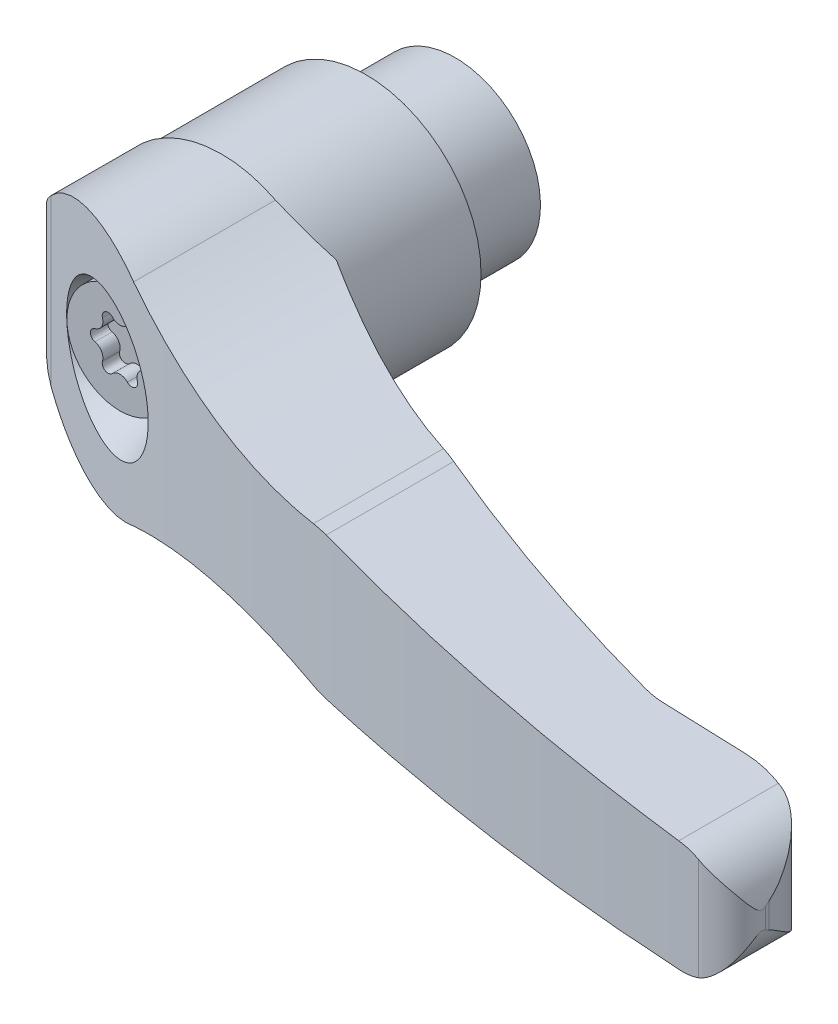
ISO-10303-21;
HEADER;
FILE_DESCRIPTION(('STEP AP214'),'2;1');
FILE_NAME('part.step','',(''),(''),'','','');
FILE_SCHEMA(('AUTOMOTIVE_DESIGN { 1 0 10303 214 1 1 1 1 }'));
ENDSEC;
DATA;
#1=APPLICATION_CONTEXT('core data for automotive mechanical design processes');
#2=APPLICATION_PROTOCOL_DEFINITION('international standard','automotive_design',2000,#1);
#3=PRODUCT_CONTEXT('',#1,'mechanical');
#4=PRODUCT('Part','Part','',(#3));
#5=PRODUCT_RELATED_PRODUCT_CATEGORY('part','',(#4));
#6=PRODUCT_DEFINITION_FORMATION('','',#4);
#7=PRODUCT_DEFINITION_CONTEXT('part definition',#1,'design');
#8=PRODUCT_DEFINITION('design','',#6,#7);
#9=PRODUCT_DEFINITION_SHAPE('','',#8);
#10=(LENGTH_UNIT() NAMED_UNIT(*) SI_UNIT(.MILLI.,.METRE.));
#11=(NAMED_UNIT(*) PLANE_ANGLE_UNIT() SI_UNIT($,.RADIAN.));
#12=(NAMED_UNIT(*) SI_UNIT($,.STERADIAN.) SOLID_ANGLE_UNIT());
#13=UNCERTAINTY_MEASURE_WITH_UNIT(LENGTH_MEASURE(1.E-05),#10,'distance_accuracy_value','');
#14=(GEOMETRIC_REPRESENTATION_CONTEXT(3) GLOBAL_UNCERTAINTY_ASSIGNED_CONTEXT((#13)) GLOBAL_UNIT_ASSIGNED_CONTEXT((#10,
#11,#12)) REPRESENTATION_CONTEXT('',''));
#15=CARTESIAN_POINT('',(0.,0.,0.));
#16=DIRECTION('',(0.,0.,1.));
#17=DIRECTION('',(1.,0.,0.));
#18=AXIS2_PLACEMENT_3D('',#15,#16,#17);
#19=CARTESIAN_POINT('',(0.,0.,23.));
#20=DIRECTION('',(0.,0.,-1.));
#21=DIRECTION('',(0.,1.,0.));
#22=AXIS2_PLACEMENT_3D('',#19,#20,#21);
#23=PLANE('',#22);
#24=CARTESIAN_POINT('',(0.,0.,23.));
#25=DIRECTION('',(0.,0.,-1.));
#26=DIRECTION('',(0.,1.,0.));
#27=AXIS2_PLACEMENT_3D('',#24,#25,#26);
#28=CIRCLE('',#27,8.);
#29=CARTESIAN_POINT('',(0.,8.,23.));
#30=VERTEX_POINT('',#29);
#31=EDGE_CURVE('E1010',#30,#30,#28,.T.);
#32=ORIENTED_EDGE('',*,*,#31,.T.);
#33=EDGE_LOOP('',(#32));
#34=FACE_BOUND('',#33,.T.);
#35=ADVANCED_FACE('F14',(#34),#23,.T.);
#36=CARTESIAN_POINT('',(0.,0.,23.));
#37=DIRECTION('',(0.,0.,-1.));
#38=DIRECTION('',(0.,1.,0.));
#39=AXIS2_PLACEMENT_3D('',#36,#37,#38);
#40=CYLINDRICAL_SURFACE('',#39,8.);
#41=CARTESIAN_POINT('',(0.,0.,1.));
#42=DIRECTION('',(0.,0.,-1.));
#43=DIRECTION('',(-1.,0.,0.));
#44=AXIS2_PLACEMENT_3D('',#41,#42,#43);
#45=CIRCLE('',#44,8.);
#46=CARTESIAN_POINT('',(-8.,0.,1.));
#47=VERTEX_POINT('',#46);
#48=EDGE_CURVE('E23',#47,#47,#45,.T.);
#49=ORIENTED_EDGE('',*,*,#48,.T.);
#50=EDGE_LOOP('',(#49));
#51=FACE_BOUND('',#50,.T.);
#52=ORIENTED_EDGE('',*,*,#31,.F.);
#53=EDGE_LOOP('',(#52));
#54=FACE_BOUND('',#53,.T.);
#55=ADVANCED_FACE('F939',(#51,#54),#40,.F.);
#56=CARTESIAN_POINT('',(11.5,0.,0.));
#57=DIRECTION('',(0.,0.,-1.));
#58=DIRECTION('',(0.,1.,0.));
#59=AXIS2_PLACEMENT_3D('',#56,#57,#58);
#60=PLANE('',#59);
#61=CARTESIAN_POINT('',(0.,0.,0.));
#62=DIRECTION('',(0.,0.,-1.));
#63=DIRECTION('',(-1.,0.,0.));
#64=AXIS2_PLACEMENT_3D('',#61,#62,#63);
#65=CIRCLE('',#64,9.);
#66=CARTESIAN_POINT('',(-9.,0.,0.));
#67=VERTEX_POINT('',#66);
#68=EDGE_CURVE('E9',#67,#67,#65,.F.);
#69=ORIENTED_EDGE('',*,*,#68,.T.);
#70=EDGE_LOOP('',(#69));
#71=FACE_BOUND('',#70,.T.);
#72=CARTESIAN_POINT('',(0.,0.,0.));
#73=DIRECTION('',(0.,0.,1.));
#74=DIRECTION('',(0.,-1.,0.));
#75=AXIS2_PLACEMENT_3D('',#72,#73,#74);
#76=CIRCLE('',#75,11.5);
#77=CARTESIAN_POINT('',(0.,-11.5,0.));
#78=VERTEX_POINT('',#77);
#79=EDGE_CURVE('E958',#78,#78,#76,.T.);
#80=ORIENTED_EDGE('',*,*,#79,.F.);
#81=EDGE_LOOP('',(#80));
#82=FACE_BOUND('',#81,.T.);
#83=ADVANCED_FACE('F920',(#71,#82),#60,.T.);
#84=CARTESIAN_POINT('',(0.,0.,12.));
#85=DIRECTION('',(0.,0.,1.));
#86=DIRECTION('',(0.,-1.,0.));
#87=AXIS2_PLACEMENT_3D('',#84,#85,#86);
#88=CYLINDRICAL_SURFACE('',#87,11.5);
#89=ORIENTED_EDGE('',*,*,#79,.T.);
#90=EDGE_LOOP('',(#89));
#91=FACE_BOUND('',#90,.T.);
#92=CARTESIAN_POINT('',(0.,0.,12.75));
#93=DIRECTION('',(0.,0.,1.));
#94=DIRECTION('',(0.,-1.,0.));
#95=AXIS2_PLACEMENT_3D('',#92,#93,#94);
#96=CIRCLE('',#95,11.5);
#97=CARTESIAN_POINT('',(0.,-11.5,12.75));
#98=VERTEX_POINT('',#97);
#99=EDGE_CURVE('E592',#98,#98,#96,.T.);
#100=ORIENTED_EDGE('',*,*,#99,.F.);
#101=EDGE_LOOP('',(#100));
#102=FACE_BOUND('',#101,.T.);
#103=ADVANCED_FACE('F564',(#91,#102),#88,.T.);
#104=CARTESIAN_POINT('',(7.15,0.,42.87));
#105=DIRECTION('',(0.,0.,-1.));
#106=DIRECTION('',(0.,1.,0.));
#107=AXIS2_PLACEMENT_3D('',#104,#105,#106);
#108=PLANE('',#107);
#109=CARTESIAN_POINT('',(1.59,2.75396078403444,42.87));
#110=DIRECTION('',(0.,0.,-1.));
#111=DIRECTION('',(0.,1.,0.));
#112=AXIS2_PLACEMENT_3D('',#109,#110,#111);
#113=CIRCLE('',#112,0.795000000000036);
#114=CARTESIAN_POINT('',(2.3516351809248,2.5260642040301,42.87));
#115=VERTEX_POINT('',#114);
#116=CARTESIAN_POINT('',(1.0118181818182,3.2996079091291,42.87));
#117=VERTEX_POINT('',#116);
#118=EDGE_CURVE('E1051',#115,#117,#113,.F.);
#119=ORIENTED_EDGE('',*,*,#118,.T.);
#120=CARTESIAN_POINT('',(0.,4.25449037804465,42.87));
#121=DIRECTION('',(0.,0.,-1.));
#122=DIRECTION('',(0.,1.,0.));
#123=AXIS2_PLACEMENT_3D('',#120,#121,#122);
#124=CIRCLE('',#123,1.39125000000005);
#125=CARTESIAN_POINT('',(-1.0118181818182,3.2996079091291,42.87));
#126=VERTEX_POINT('',#125);
#127=EDGE_CURVE('E992',#126,#117,#124,.F.);
#128=ORIENTED_EDGE('',*,*,#127,.F.);
#129=CARTESIAN_POINT('',(-1.58999999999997,2.75396078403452,42.87));
#130=DIRECTION('',(0.,0.,-1.));
#131=DIRECTION('',(0.,1.,0.));
#132=AXIS2_PLACEMENT_3D('',#129,#130,#131);
#133=CIRCLE('',#132,0.794999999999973);
#134=CARTESIAN_POINT('',(-2.3516351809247,2.5260642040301,42.87));
#135=VERTEX_POINT('',#134);
#136=EDGE_CURVE('E1047',#126,#135,#133,.F.);
#137=ORIENTED_EDGE('',*,*,#136,.T.);
#138=CARTESIAN_POINT('',(-3.68449674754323,2.12724518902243,42.87));
#139=DIRECTION('',(0.,0.,-1.));
#140=DIRECTION('',(0.,1.,0.));
#141=AXIS2_PLACEMENT_3D('',#138,#139,#140);
#142=CIRCLE('',#141,1.39125000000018);
#143=CARTESIAN_POINT('',(-3.3634533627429,0.77354370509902,42.87));
#144=VERTEX_POINT('',#143);
#145=EDGE_CURVE('E996',#144,#135,#142,.F.);
#146=ORIENTED_EDGE('',*,*,#145,.F.);
#147=CARTESIAN_POINT('',(-3.18,0.,42.87));
#148=DIRECTION('',(0.,0.,-1.));
#149=DIRECTION('',(0.,1.,0.));
#150=AXIS2_PLACEMENT_3D('',#147,#148,#149);
#151=CIRCLE('',#150,0.795);
#152=CARTESIAN_POINT('',(-3.3634533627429,-0.77354370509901,42.87));
#153=VERTEX_POINT('',#152);
#154=EDGE_CURVE('E108',#144,#153,#151,.F.);
#155=ORIENTED_EDGE('',*,*,#154,.T.);
#156=CARTESIAN_POINT('',(-3.68449674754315,-2.12724518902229,42.87));
#157=DIRECTION('',(0.,0.,-1.));
#158=DIRECTION('',(0.,1.,0.));
#159=AXIS2_PLACEMENT_3D('',#156,#157,#158);
#160=CIRCLE('',#159,1.39125000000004);
#161=CARTESIAN_POINT('',(-2.3516351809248,-2.5260642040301,42.87));
#162=VERTEX_POINT('',#161);
#163=EDGE_CURVE('E999',#162,#153,#160,.F.);
#164=ORIENTED_EDGE('',*,*,#163,.F.);
#165=CARTESIAN_POINT('',(-1.59,-2.75396078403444,42.87));
#166=DIRECTION('',(0.,0.,-1.));
#167=DIRECTION('',(0.,1.,0.));
#168=AXIS2_PLACEMENT_3D('',#165,#166,#167);
#169=CIRCLE('',#168,0.795000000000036);
#170=CARTESIAN_POINT('',(-1.0118181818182,-3.2996079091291,42.87));
#171=VERTEX_POINT('',#170);
#172=EDGE_CURVE('E1066',#162,#171,#169,.F.);
#173=ORIENTED_EDGE('',*,*,#172,.T.);
#174=CARTESIAN_POINT('',(0.,-4.25449037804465,42.87));
#175=DIRECTION('',(0.,0.,-1.));
#176=DIRECTION('',(0.,1.,0.));
#177=AXIS2_PLACEMENT_3D('',#174,#175,#176);
#178=CIRCLE('',#177,1.39125000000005);
#179=CARTESIAN_POINT('',(1.0118181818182,-3.2996079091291,42.87));
#180=VERTEX_POINT('',#179);
#181=EDGE_CURVE('E1001',#180,#171,#178,.F.);
#182=ORIENTED_EDGE('',*,*,#181,.F.);
#183=CARTESIAN_POINT('',(1.58999999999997,-2.75396078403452,42.87));
#184=DIRECTION('',(0.,0.,-1.));
#185=DIRECTION('',(0.,1.,0.));
#186=AXIS2_PLACEMENT_3D('',#183,#184,#185);
#187=CIRCLE('',#186,0.794999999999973);
#188=CARTESIAN_POINT('',(2.3516351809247,-2.5260642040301,42.87));
#189=VERTEX_POINT('',#188);
#190=EDGE_CURVE('E1061',#180,#189,#187,.F.);
#191=ORIENTED_EDGE('',*,*,#190,.T.);
#192=CARTESIAN_POINT('',(3.68449674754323,-2.12724518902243,42.87));
#193=DIRECTION('',(0.,0.,-1.));
#194=DIRECTION('',(0.,1.,0.));
#195=AXIS2_PLACEMENT_3D('',#192,#193,#194);
#196=CIRCLE('',#195,1.39125000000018);
#197=CARTESIAN_POINT('',(3.3634533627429,-0.77354370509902,42.87));
#198=VERTEX_POINT('',#197);
#199=EDGE_CURVE('E1004',#198,#189,#196,.F.);
#200=ORIENTED_EDGE('',*,*,#199,.F.);
#201=CARTESIAN_POINT('',(3.18,0.,42.87));
#202=DIRECTION('',(0.,0.,-1.));
#203=DIRECTION('',(0.,1.,0.));
#204=AXIS2_PLACEMENT_3D('',#201,#202,#203);
#205=CIRCLE('',#204,0.795);
#206=CARTESIAN_POINT('',(3.3634533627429,0.77354370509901,42.87));
#207=VERTEX_POINT('',#206);
#208=EDGE_CURVE('E1056',#198,#207,#205,.F.);
#209=ORIENTED_EDGE('',*,*,#208,.T.);
#210=CARTESIAN_POINT('',(3.68449674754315,2.12724518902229,42.87));
#211=DIRECTION('',(0.,0.,-1.));
#212=DIRECTION('',(0.,1.,0.));
#213=AXIS2_PLACEMENT_3D('',#210,#211,#212);
#214=CIRCLE('',#213,1.39125000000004);
#215=EDGE_CURVE('E1007',#115,#207,#214,.F.);
#216=ORIENTED_EDGE('',*,*,#215,.F.);
#217=EDGE_LOOP('',(#119,#128,#137,#146,#155,#164,#173,#182,#191,#200,#209,#216));
#218=FACE_BOUND('',#217,.T.);
#219=ADVANCED_FACE('F897',(#218),#108,.F.);
#220=CARTESIAN_POINT('',(-3.68449674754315,-2.12724518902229,49.24));
#221=DIRECTION('',(0.,0.,-1.));
#222=DIRECTION('',(0.,1.,0.));
#223=AXIS2_PLACEMENT_3D('',#220,#221,#222);
#224=CYLINDRICAL_SURFACE('',#223,1.39125000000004);
#225=DIRECTION('',(0.,0.,-1.));
#226=VECTOR('',#225,1.);
#227=CARTESIAN_POINT('',(-2.3516351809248,-2.5260642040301,49.24));
#228=LINE('',#227,#226);
#229=CARTESIAN_POINT('',(-2.3516351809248,-2.5260642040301,45.19));
#230=VERTEX_POINT('',#229);
#231=EDGE_CURVE('E1040',#230,#162,#228,.T.);
#232=ORIENTED_EDGE('',*,*,#231,.T.);
#233=ORIENTED_EDGE('',*,*,#163,.T.);
#234=DIRECTION('',(0.,0.,-1.));
#235=VECTOR('',#234,1.);
#236=CARTESIAN_POINT('',(-3.3634533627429,-0.77354370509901,49.24));
#237=LINE('',#236,#235);
#238=CARTESIAN_POINT('',(-3.3634533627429,-0.77354370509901,45.19));
#239=VERTEX_POINT('',#238);
#240=EDGE_CURVE('E1043',#239,#153,#237,.T.);
#241=ORIENTED_EDGE('',*,*,#240,.F.);
#242=CARTESIAN_POINT('',(-3.68449674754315,-2.12724518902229,45.19));
#243=DIRECTION('',(0.,0.,1.));
#244=DIRECTION('',(0.,-1.,0.));
#245=AXIS2_PLACEMENT_3D('',#242,#243,#244);
#246=CIRCLE('',#245,1.39125000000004);
#247=EDGE_CURVE('E956',#230,#239,#246,.T.);
#248=ORIENTED_EDGE('',*,*,#247,.F.);
#249=EDGE_LOOP('',(#232,#233,#241,#248));
#250=FACE_BOUND('',#249,.T.);
#251=ADVANCED_FACE('F908',(#250),#224,.T.);
#252=CARTESIAN_POINT('',(-1.59,-2.75396078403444,49.24));
#253=DIRECTION('',(0.,0.,-1.));
#254=DIRECTION('',(0.,1.,0.));
#255=AXIS2_PLACEMENT_3D('',#252,#253,#254);
#256=CYLINDRICAL_SURFACE('',#255,0.795000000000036);
#257=DIRECTION('',(0.,0.,-1.));
#258=VECTOR('',#257,1.);
#259=CARTESIAN_POINT('',(-1.0118181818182,-3.2996079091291,49.24));
#260=LINE('',#259,#258);
#261=CARTESIAN_POINT('',(-1.0118181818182,-3.2996079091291,45.19));
#262=VERTEX_POINT('',#261);
#263=EDGE_CURVE('E1037',#262,#171,#260,.T.);
#264=ORIENTED_EDGE('',*,*,#263,.T.);
#265=ORIENTED_EDGE('',*,*,#172,.F.);
#266=ORIENTED_EDGE('',*,*,#231,.F.);
#267=CARTESIAN_POINT('',(-1.59,-2.75396078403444,45.19));
#268=DIRECTION('',(0.,0.,1.));
#269=DIRECTION('',(0.,-1.,0.));
#270=AXIS2_PLACEMENT_3D('',#267,#268,#269);
#271=CIRCLE('',#270,0.795000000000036);
#272=EDGE_CURVE('E962',#262,#230,#271,.F.);
#273=ORIENTED_EDGE('',*,*,#272,.F.);
#274=EDGE_LOOP('',(#264,#265,#266,#273));
#275=FACE_BOUND('',#274,.T.);
#276=ADVANCED_FACE('F916',(#275),#256,.F.);
#277=CARTESIAN_POINT('',(0.,-4.25449037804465,49.24));
#278=DIRECTION('',(0.,0.,-1.));
#279=DIRECTION('',(0.,1.,0.));
#280=AXIS2_PLACEMENT_3D('',#277,#278,#279);
#281=CYLINDRICAL_SURFACE('',#280,1.39125000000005);
#282=DIRECTION('',(0.,0.,-1.));
#283=VECTOR('',#282,1.);
#284=CARTESIAN_POINT('',(1.0118181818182,-3.2996079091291,49.24));
#285=LINE('',#284,#283);
#286=CARTESIAN_POINT('',(1.0118181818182,-3.2996079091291,45.19));
#287=VERTEX_POINT('',#286);
#288=EDGE_CURVE('E1034',#287,#180,#285,.T.);
#289=ORIENTED_EDGE('',*,*,#288,.T.);
#290=ORIENTED_EDGE('',*,*,#181,.T.);
#291=ORIENTED_EDGE('',*,*,#263,.F.);
#292=CARTESIAN_POINT('',(0.,-4.25449037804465,45.19));
#293=DIRECTION('',(0.,0.,1.));
#294=DIRECTION('',(0.,-1.,0.));
#295=AXIS2_PLACEMENT_3D('',#292,#293,#294);
#296=CIRCLE('',#295,1.39125000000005);
#297=EDGE_CURVE('E976',#287,#262,#296,.T.);
#298=ORIENTED_EDGE('',*,*,#297,.F.);
#299=EDGE_LOOP('',(#289,#290,#291,#298));
#300=FACE_BOUND('',#299,.T.);
#301=ADVANCED_FACE('F1071',(#300),#281,.T.);
#302=CARTESIAN_POINT('',(1.58999999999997,-2.75396078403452,49.24));
#303=DIRECTION('',(0.,0.,-1.));
#304=DIRECTION('',(0.,1.,0.));
#305=AXIS2_PLACEMENT_3D('',#302,#303,#304);
#306=CYLINDRICAL_SURFACE('',#305,0.794999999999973);
#307=DIRECTION('',(0.,0.,-1.));
#308=VECTOR('',#307,1.);
#309=CARTESIAN_POINT('',(2.3516351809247,-2.5260642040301,49.24));
#310=LINE('',#309,#308);
#311=CARTESIAN_POINT('',(2.3516351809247,-2.5260642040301,45.19));
#312=VERTEX_POINT('',#311);
#313=EDGE_CURVE('E1031',#312,#189,#310,.T.);
#314=ORIENTED_EDGE('',*,*,#313,.T.);
#315=ORIENTED_EDGE('',*,*,#190,.F.);
#316=ORIENTED_EDGE('',*,*,#288,.F.);
#317=CARTESIAN_POINT('',(1.58999999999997,-2.75396078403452,45.19));
#318=DIRECTION('',(0.,0.,1.));
#319=DIRECTION('',(0.,-1.,0.));
#320=AXIS2_PLACEMENT_3D('',#317,#318,#319);
#321=CIRCLE('',#320,0.794999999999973);
#322=EDGE_CURVE('E1063',#312,#287,#321,.F.);
#323=ORIENTED_EDGE('',*,*,#322,.F.);
#324=EDGE_LOOP('',(#314,#315,#316,#323));
#325=FACE_BOUND('',#324,.T.);
#326=ADVANCED_FACE('F1080',(#325),#306,.F.);
#327=CARTESIAN_POINT('',(3.68449674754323,-2.12724518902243,49.24));
#328=DIRECTION('',(0.,0.,-1.));
#329=DIRECTION('',(0.,1.,0.));
#330=AXIS2_PLACEMENT_3D('',#327,#328,#329);
#331=CYLINDRICAL_SURFACE('',#330,1.39125000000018);
#332=DIRECTION('',(0.,0.,-1.));
#333=VECTOR('',#332,1.);
#334=CARTESIAN_POINT('',(3.3634533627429,-0.77354370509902,49.24));
#335=LINE('',#334,#333);
#336=CARTESIAN_POINT('',(3.3634533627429,-0.77354370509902,45.19));
#337=VERTEX_POINT('',#336);
#338=EDGE_CURVE('E1028',#337,#198,#335,.T.);
#339=ORIENTED_EDGE('',*,*,#338,.T.);
#340=ORIENTED_EDGE('',*,*,#199,.T.);
#341=ORIENTED_EDGE('',*,*,#313,.F.);
#342=CARTESIAN_POINT('',(3.68449674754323,-2.12724518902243,45.19));
#343=DIRECTION('',(0.,0.,1.));
#344=DIRECTION('',(0.,-1.,0.));
#345=AXIS2_PLACEMENT_3D('',#342,#343,#344);
#346=CIRCLE('',#345,1.39125000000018);
#347=EDGE_CURVE('E973',#337,#312,#346,.T.);
#348=ORIENTED_EDGE('',*,*,#347,.F.);
#349=EDGE_LOOP('',(#339,#340,#341,#348));
#350=FACE_BOUND('',#349,.T.);
#351=ADVANCED_FACE('F1078',(#350),#331,.T.);
#352=CARTESIAN_POINT('',(3.18,0.,49.24));
#353=DIRECTION('',(0.,0.,-1.));
#354=DIRECTION('',(0.,1.,0.));
#355=AXIS2_PLACEMENT_3D('',#352,#353,#354);
#356=CYLINDRICAL_SURFACE('',#355,0.795);
#357=DIRECTION('',(0.,0.,-1.));
#358=VECTOR('',#357,1.);
#359=CARTESIAN_POINT('',(3.3634533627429,0.77354370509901,49.24));
#360=LINE('',#359,#358);
#361=CARTESIAN_POINT('',(3.3634533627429,0.77354370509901,45.19));
#362=VERTEX_POINT('',#361);
#363=EDGE_CURVE('E1025',#362,#207,#360,.T.);
#364=ORIENTED_EDGE('',*,*,#363,.T.);
#365=ORIENTED_EDGE('',*,*,#208,.F.);
#366=ORIENTED_EDGE('',*,*,#338,.F.);
#367=CARTESIAN_POINT('',(3.18,0.,45.19));
#368=DIRECTION('',(0.,0.,1.));
#369=DIRECTION('',(0.,-1.,0.));
#370=AXIS2_PLACEMENT_3D('',#367,#368,#369);
#371=CIRCLE('',#370,0.795);
#372=EDGE_CURVE('E1058',#362,#337,#371,.F.);
#373=ORIENTED_EDGE('',*,*,#372,.F.);
#374=EDGE_LOOP('',(#364,#365,#366,#373));
#375=FACE_BOUND('',#374,.T.);
#376=ADVANCED_FACE('F1082',(#375),#356,.F.);
#377=CARTESIAN_POINT('',(3.68449674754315,2.12724518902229,49.24));
#378=DIRECTION('',(0.,0.,-1.));
#379=DIRECTION('',(0.,1.,0.));
#380=AXIS2_PLACEMENT_3D('',#377,#378,#379);
#381=CYLINDRICAL_SURFACE('',#380,1.39125000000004);
#382=DIRECTION('',(0.,0.,-1.));
#383=VECTOR('',#382,1.);
#384=CARTESIAN_POINT('',(2.3516351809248,2.5260642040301,49.24));
#385=LINE('',#384,#383);
#386=CARTESIAN_POINT('',(2.3516351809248,2.5260642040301,45.19));
#387=VERTEX_POINT('',#386);
#388=EDGE_CURVE('E1022',#387,#115,#385,.T.);
#389=ORIENTED_EDGE('',*,*,#388,.T.);
#390=ORIENTED_EDGE('',*,*,#215,.T.);
#391=ORIENTED_EDGE('',*,*,#363,.F.);
#392=CARTESIAN_POINT('',(3.68449674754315,2.12724518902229,45.19));
#393=DIRECTION('',(0.,0.,1.));
#394=DIRECTION('',(0.,-1.,0.));
#395=AXIS2_PLACEMENT_3D('',#392,#393,#394);
#396=CIRCLE('',#395,1.39125000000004);
#397=EDGE_CURVE('E970',#387,#362,#396,.T.);
#398=ORIENTED_EDGE('',*,*,#397,.F.);
#399=EDGE_LOOP('',(#389,#390,#391,#398));
#400=FACE_BOUND('',#399,.T.);
#401=ADVANCED_FACE('F1086',(#400),#381,.T.);
#402=CARTESIAN_POINT('',(1.59,2.75396078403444,49.24));
#403=DIRECTION('',(0.,0.,-1.));
#404=DIRECTION('',(0.,1.,0.));
#405=AXIS2_PLACEMENT_3D('',#402,#403,#404);
#406=CYLINDRICAL_SURFACE('',#405,0.795000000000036);
#407=ORIENTED_EDGE('',*,*,#118,.F.);
#408=ORIENTED_EDGE('',*,*,#388,.F.);
#409=CARTESIAN_POINT('',(1.59,2.75396078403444,45.19));
#410=DIRECTION('',(0.,0.,1.));
#411=DIRECTION('',(0.,-1.,0.));
#412=AXIS2_PLACEMENT_3D('',#409,#410,#411);
#413=CIRCLE('',#412,0.795000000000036);
#414=CARTESIAN_POINT('',(1.0118181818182,3.2996079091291,45.19));
#415=VERTEX_POINT('',#414);
#416=EDGE_CURVE('E1053',#415,#387,#413,.F.);
#417=ORIENTED_EDGE('',*,*,#416,.F.);
#418=DIRECTION('',(0.,0.,-1.));
#419=VECTOR('',#418,1.);
#420=CARTESIAN_POINT('',(1.0118181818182,3.2996079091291,49.24));
#421=LINE('',#420,#419);
#422=EDGE_CURVE('E1019',#415,#117,#421,.T.);
#423=ORIENTED_EDGE('',*,*,#422,.T.);
#424=EDGE_LOOP('',(#407,#408,#417,#423));
#425=FACE_BOUND('',#424,.T.);
#426=ADVANCED_FACE('F1089',(#425),#406,.F.);
#427=CARTESIAN_POINT('',(0.,4.25449037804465,49.24));
#428=DIRECTION('',(0.,0.,-1.));
#429=DIRECTION('',(0.,1.,0.));
#430=AXIS2_PLACEMENT_3D('',#427,#428,#429);
#431=CYLINDRICAL_SURFACE('',#430,1.39125000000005);
#432=DIRECTION('',(0.,0.,-1.));
#433=VECTOR('',#432,1.);
#434=CARTESIAN_POINT('',(-1.0118181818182,3.2996079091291,49.24));
#435=LINE('',#434,#433);
#436=CARTESIAN_POINT('',(-1.0118181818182,3.2996079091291,45.19));
#437=VERTEX_POINT('',#436);
#438=EDGE_CURVE('E1016',#437,#126,#435,.T.);
#439=ORIENTED_EDGE('',*,*,#438,.T.);
#440=ORIENTED_EDGE('',*,*,#127,.T.);
#441=ORIENTED_EDGE('',*,*,#422,.F.);
#442=CARTESIAN_POINT('',(0.,4.25449037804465,45.19));
#443=DIRECTION('',(0.,0.,1.));
#444=DIRECTION('',(0.,-1.,0.));
#445=AXIS2_PLACEMENT_3D('',#442,#443,#444);
#446=CIRCLE('',#445,1.39125000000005);
#447=EDGE_CURVE('E967',#437,#415,#446,.T.);
#448=ORIENTED_EDGE('',*,*,#447,.F.);
#449=EDGE_LOOP('',(#439,#440,#441,#448));
#450=FACE_BOUND('',#449,.T.);
#451=ADVANCED_FACE('F934',(#450),#431,.T.);
#452=CARTESIAN_POINT('',(-1.58999999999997,2.75396078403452,49.24));
#453=DIRECTION('',(0.,0.,-1.));
#454=DIRECTION('',(0.,1.,0.));
#455=AXIS2_PLACEMENT_3D('',#452,#453,#454);
#456=CYLINDRICAL_SURFACE('',#455,0.794999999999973);
#457=ORIENTED_EDGE('',*,*,#136,.F.);
#458=ORIENTED_EDGE('',*,*,#438,.F.);
#459=CARTESIAN_POINT('',(-1.58999999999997,2.75396078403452,45.19));
#460=DIRECTION('',(0.,0.,1.));
#461=DIRECTION('',(0.,-1.,0.));
#462=AXIS2_PLACEMENT_3D('',#459,#460,#461);
#463=CIRCLE('',#462,0.794999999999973);
#464=CARTESIAN_POINT('',(-2.3516351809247,2.5260642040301,45.19));
#465=VERTEX_POINT('',#464);
#466=EDGE_CURVE('E1049',#465,#437,#463,.F.);
#467=ORIENTED_EDGE('',*,*,#466,.F.);
#468=DIRECTION('',(0.,0.,-1.));
#469=VECTOR('',#468,1.);
#470=CARTESIAN_POINT('',(-2.3516351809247,2.5260642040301,49.24));
#471=LINE('',#470,#469);
#472=EDGE_CURVE('E1013',#465,#135,#471,.T.);
#473=ORIENTED_EDGE('',*,*,#472,.T.);
#474=EDGE_LOOP('',(#457,#458,#467,#473));
#475=FACE_BOUND('',#474,.T.);
#476=ADVANCED_FACE('F925',(#475),#456,.F.);
#477=CARTESIAN_POINT('',(-3.68449674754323,2.12724518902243,49.24));
#478=DIRECTION('',(0.,0.,-1.));
#479=DIRECTION('',(0.,1.,0.));
#480=AXIS2_PLACEMENT_3D('',#477,#478,#479);
#481=CYLINDRICAL_SURFACE('',#480,1.39125000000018);
#482=DIRECTION('',(0.,0.,-1.));
#483=VECTOR('',#482,1.);
#484=CARTESIAN_POINT('',(-3.3634533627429,0.77354370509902,49.24));
#485=LINE('',#484,#483);
#486=CARTESIAN_POINT('',(-3.3634533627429,0.77354370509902,45.19));
#487=VERTEX_POINT('',#486);
#488=EDGE_CURVE('E1045',#487,#144,#485,.T.);
#489=ORIENTED_EDGE('',*,*,#488,.T.);
#490=ORIENTED_EDGE('',*,*,#145,.T.);
#491=ORIENTED_EDGE('',*,*,#472,.F.);
#492=CARTESIAN_POINT('',(-3.68449674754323,2.12724518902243,45.19));
#493=DIRECTION('',(0.,0.,1.));
#494=DIRECTION('',(0.,-1.,0.));
#495=AXIS2_PLACEMENT_3D('',#492,#493,#494);
#496=CIRCLE('',#495,1.39125000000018);
#497=EDGE_CURVE('E954',#487,#465,#496,.T.);
#498=ORIENTED_EDGE('',*,*,#497,.F.);
#499=EDGE_LOOP('',(#489,#490,#491,#498));
#500=FACE_BOUND('',#499,.T.);
#501=ADVANCED_FACE('F910',(#500),#481,.T.);
#502=CARTESIAN_POINT('',(-3.18,0.,49.24));
#503=DIRECTION('',(0.,0.,-1.));
#504=DIRECTION('',(0.,1.,0.));
#505=AXIS2_PLACEMENT_3D('',#502,#503,#504);
#506=CYLINDRICAL_SURFACE('',#505,0.795);
#507=ORIENTED_EDGE('',*,*,#240,.T.);
#508=ORIENTED_EDGE('',*,*,#154,.F.);
#509=ORIENTED_EDGE('',*,*,#488,.F.);
#510=CARTESIAN_POINT('',(-3.18,0.,45.19));
#511=DIRECTION('',(0.,0.,1.));
#512=DIRECTION('',(0.,-1.,0.));
#513=AXIS2_PLACEMENT_3D('',#510,#511,#512);
#514=CIRCLE('',#513,0.795);
#515=EDGE_CURVE('E952',#239,#487,#514,.F.);
#516=ORIENTED_EDGE('',*,*,#515,.F.);
#517=EDGE_LOOP('',(#507,#508,#509,#516));
#518=FACE_BOUND('',#517,.T.);
#519=ADVANCED_FACE('F919',(#518),#506,.F.);
#520=CARTESIAN_POINT('',(0.,0.,45.19));
#521=DIRECTION('',(0.,0.,1.));
#522=DIRECTION('',(0.,-1.,0.));
#523=AXIS2_PLACEMENT_3D('',#520,#521,#522);
#524=PLANE('',#523);
#525=CARTESIAN_POINT('',(0.,0.,45.19));
#526=DIRECTION('',(0.,0.,1.));
#527=DIRECTION('',(0.,-1.,0.));
#528=AXIS2_PLACEMENT_3D('',#525,#526,#527);
#529=CIRCLE('',#528,7.15);
#530=CARTESIAN_POINT('',(0.,-7.15,45.19));
#531=VERTEX_POINT('',#530);
#532=EDGE_CURVE('E948',#531,#531,#529,.T.);
#533=ORIENTED_EDGE('',*,*,#532,.T.);
#534=EDGE_LOOP('',(#533));
#535=FACE_BOUND('',#534,.T.);
#536=ORIENTED_EDGE('',*,*,#515,.T.);
#537=ORIENTED_EDGE('',*,*,#497,.T.);
#538=ORIENTED_EDGE('',*,*,#466,.T.);
#539=ORIENTED_EDGE('',*,*,#447,.T.);
#540=ORIENTED_EDGE('',*,*,#416,.T.);
#541=ORIENTED_EDGE('',*,*,#397,.T.);
#542=ORIENTED_EDGE('',*,*,#372,.T.);
#543=ORIENTED_EDGE('',*,*,#347,.T.);
#544=ORIENTED_EDGE('',*,*,#322,.T.);
#545=ORIENTED_EDGE('',*,*,#297,.T.);
#546=ORIENTED_EDGE('',*,*,#272,.T.);
#547=ORIENTED_EDGE('',*,*,#247,.T.);
#548=EDGE_LOOP('',(#536,#537,#538,#539,#540,#541,#542,#543,#544,#545,#546,#547));
#549=FACE_BOUND('',#548,.T.);
#550=ADVANCED_FACE('F561',(#535,#549),#524,.T.);
#551=CARTESIAN_POINT('',(0.,0.,12.));
#552=DIRECTION('',(0.,0.,1.));
#553=DIRECTION('',(0.,-1.,0.));
#554=AXIS2_PLACEMENT_3D('',#551,#552,#553);
#555=CYLINDRICAL_SURFACE('',#554,7.15);
#556=CARTESIAN_POINT('',(0.,0.,42.87));
#557=DIRECTION('',(0.,0.,1.));
#558=DIRECTION('',(0.,-1.,0.));
#559=AXIS2_PLACEMENT_3D('',#556,#557,#558);
#560=CIRCLE('',#559,7.15);
#561=CARTESIAN_POINT('',(0.,-7.15,42.87));
#562=VERTEX_POINT('',#561);
#563=EDGE_CURVE('E587',#562,#562,#560,.T.);
#564=ORIENTED_EDGE('',*,*,#563,.T.);
#565=EDGE_LOOP('',(#564));
#566=FACE_BOUND('',#565,.T.);
#567=ORIENTED_EDGE('',*,*,#532,.F.);
#568=EDGE_LOOP('',(#567));
#569=FACE_BOUND('',#568,.T.);
#570=ADVANCED_FACE('F554',(#566,#569),#555,.T.);
#571=CARTESIAN_POINT('',(-15.51,-17.,31.5));
#572=DIRECTION('',(0.,0.,1.));
#573=DIRECTION('',(0.,-1.,0.));
#574=AXIS2_PLACEMENT_3D('',#571,#572,#573);
#575=PLANE('',#574);
#576=CARTESIAN_POINT('',(33.7499999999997,-76.32,31.5));
#577=DIRECTION('',(0.,0.,1.));
#578=DIRECTION('',(0.,-1.,0.));
#579=AXIS2_PLACEMENT_3D('',#576,#577,#578);
#580=CIRCLE('',#579,67.48);
#581=CARTESIAN_POINT('',(7.274193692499,-14.250828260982,31.5));
#582=VERTEX_POINT('',#581);
#583=CARTESIAN_POINT('',(15.49,-11.3575277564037,31.5));
#584=VERTEX_POINT('',#583);
#585=EDGE_CURVE('E1426',#582,#584,#580,.F.);
#586=ORIENTED_EDGE('',*,*,#585,.F.);
#587=CARTESIAN_POINT('',(0.,0.,31.5));
#588=DIRECTION('',(0.,0.,1.));
#589=DIRECTION('',(0.,-1.,0.));
#590=AXIS2_PLACEMENT_3D('',#587,#588,#589);
#591=CIRCLE('',#590,16.);
#592=CARTESIAN_POINT('',(-15.51,-3.92936381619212,31.5));
#593=VERTEX_POINT('',#592);
#594=EDGE_CURVE('E1427',#593,#582,#591,.T.);
#595=ORIENTED_EDGE('',*,*,#594,.F.);
#596=DIRECTION('',(0.,1.,0.));
#597=VECTOR('',#596,1.);
#598=CARTESIAN_POINT('',(-15.51,-17.,31.5));
#599=LINE('',#598,#597);
#600=CARTESIAN_POINT('',(-15.51,0.,31.5));
#601=VERTEX_POINT('',#600);
#602=EDGE_CURVE('E266',#593,#601,#599,.T.);
#603=ORIENTED_EDGE('',*,*,#602,.T.);
#604=CARTESIAN_POINT('',(-0.0100000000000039,0.,31.5));
#605=DIRECTION('',(0.,0.,1.));
#606=DIRECTION('',(0.,-1.,0.));
#607=AXIS2_PLACEMENT_3D('',#604,#605,#606);
#608=CIRCLE('',#607,15.5);
#609=CARTESIAN_POINT('',(15.49,0.,31.5));
#610=VERTEX_POINT('',#609);
#611=EDGE_CURVE('E277',#601,#610,#608,.T.);
#612=ORIENTED_EDGE('',*,*,#611,.T.);
#613=DIRECTION('',(0.,1.,0.));
#614=VECTOR('',#613,1.);
#615=CARTESIAN_POINT('',(15.49,-17.,31.5));
#616=LINE('',#615,#614);
#617=EDGE_CURVE('E305',#584,#610,#616,.T.);
#618=ORIENTED_EDGE('',*,*,#617,.F.);
#619=EDGE_LOOP('',(#586,#595,#603,#612,#618));
#620=FACE_BOUND('',#619,.T.);
#621=ADVANCED_FACE('F552',(#620),#575,.F.);
#622=CARTESIAN_POINT('',(-15.51,-17.,36.780322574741));
#623=DIRECTION('',(1.,0.,0.));
#624=DIRECTION('',(0.,1.,0.));
#625=AXIS2_PLACEMENT_3D('',#622,#623,#624);
#626=PLANE('',#625);
#627=DIRECTION('',(0.,0.,1.));
#628=VECTOR('',#627,1.);
#629=CARTESIAN_POINT('',(-15.51,3.92936381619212,0.));
#630=LINE('',#629,#628);
#631=CARTESIAN_POINT('',(-15.51,3.92936381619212,31.5));
#632=VERTEX_POINT('',#631);
#633=CARTESIAN_POINT('',(-15.51,3.92936381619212,36.780322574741));
#634=VERTEX_POINT('',#633);
#635=EDGE_CURVE('E243',#632,#634,#630,.T.);
#636=ORIENTED_EDGE('',*,*,#635,.F.);
#637=EDGE_CURVE('E307',#601,#632,#599,.T.);
#638=ORIENTED_EDGE('',*,*,#637,.F.);
#639=ORIENTED_EDGE('',*,*,#602,.F.);
#640=DIRECTION('',(0.,0.,1.));
#641=VECTOR('',#640,1.);
#642=CARTESIAN_POINT('',(-15.51,-3.92936381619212,0.));
#643=LINE('',#642,#641);
#644=CARTESIAN_POINT('',(-15.51,-3.92936381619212,36.780322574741));
#645=VERTEX_POINT('',#644);
#646=EDGE_CURVE('E271',#645,#593,#643,.F.);
#647=ORIENTED_EDGE('',*,*,#646,.F.);
#648=DIRECTION('',(0.,1.,0.));
#649=VECTOR('',#648,1.);
#650=CARTESIAN_POINT('',(-15.51,-17.,36.780322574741));
#651=LINE('',#650,#649);
#652=EDGE_CURVE('E262',#645,#634,#651,.T.);
#653=ORIENTED_EDGE('',*,*,#652,.T.);
#654=EDGE_LOOP('',(#636,#638,#639,#647,#653));
#655=FACE_BOUND('',#654,.T.);
#656=ADVANCED_FACE('F269',(#655),#626,.F.);
#657=CARTESIAN_POINT('',(33.7499999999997,76.32,31.5));
#658=DIRECTION('',(0.,0.,1.));
#659=DIRECTION('',(0.,-1.,0.));
#660=AXIS2_PLACEMENT_3D('',#657,#658,#659);
#661=CIRCLE('',#660,67.48);
#662=CARTESIAN_POINT('',(15.49,11.3575277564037,31.5));
#663=VERTEX_POINT('',#662);
#664=CARTESIAN_POINT('',(7.274193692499,14.250828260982,31.5));
#665=VERTEX_POINT('',#664);
#666=EDGE_CURVE('E573',#663,#665,#661,.F.);
#667=ORIENTED_EDGE('',*,*,#666,.F.);
#668=EDGE_CURVE('E304',#610,#663,#616,.T.);
#669=ORIENTED_EDGE('',*,*,#668,.F.);
#670=EDGE_CURVE('E272',#610,#601,#608,.T.);
#671=ORIENTED_EDGE('',*,*,#670,.T.);
#672=ORIENTED_EDGE('',*,*,#637,.T.);
#673=CARTESIAN_POINT('',(0.,0.,31.5));
#674=DIRECTION('',(0.,0.,1.));
#675=DIRECTION('',(0.,-1.,0.));
#676=AXIS2_PLACEMENT_3D('',#673,#674,#675);
#677=CIRCLE('',#676,16.);
#678=EDGE_CURVE('E250',#665,#632,#677,.T.);
#679=ORIENTED_EDGE('',*,*,#678,.F.);
#680=EDGE_LOOP('',(#667,#669,#671,#672,#679));
#681=FACE_BOUND('',#680,.T.);
#682=ADVANCED_FACE('F486',(#681),#575,.F.);
#683=CARTESIAN_POINT('',(86.000715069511,-17.,46.1999999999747));
#684=DIRECTION('',(0.,1.,0.));
#685=DIRECTION('',(-1.,0.,0.));
#686=AXIS2_PLACEMENT_3D('',#683,#684,#685);
#687=CYLINDRICAL_SURFACE('',#686,11.6800000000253);
#688=CARTESIAN_POINT('',(86.000715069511,8.0934674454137,46.1999999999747));
#689=DIRECTION('',(0.0359460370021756,0.999353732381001,0.));
#690=DIRECTION('',(-0.999353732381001,0.0359460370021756,0.));
#691=AXIS2_PLACEMENT_3D('',#688,#689,#690);
#692=ELLIPSE('',#691,11.6875532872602,11.6800000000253);
#693=CARTESIAN_POINT('',(86.00071506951,8.09346744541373,57.88));
#694=VERTEX_POINT('',#693);
#695=CARTESIAN_POINT('',(83.209258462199,8.19387413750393,57.541524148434));
#696=VERTEX_POINT('',#695);
#697=EDGE_CURVE('E1431',#694,#696,#692,.F.);
#698=ORIENTED_EDGE('',*,*,#697,.F.);
#699=DIRECTION('',(0.,1.,0.));
#700=VECTOR('',#699,1.);
#701=CARTESIAN_POINT('',(86.00071506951,-17.,57.88));
#702=LINE('',#701,#700);
#703=CARTESIAN_POINT('',(86.00071506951,-8.09346744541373,57.88));
#704=VERTEX_POINT('',#703);
#705=EDGE_CURVE('E298',#704,#694,#702,.T.);
#706=ORIENTED_EDGE('',*,*,#705,.F.);
#707=CARTESIAN_POINT('',(86.000715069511,-8.0934674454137,46.1999999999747));
#708=DIRECTION('',(0.0359460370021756,-0.999353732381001,0.));
#709=DIRECTION('',(0.999353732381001,0.0359460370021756,0.));
#710=AXIS2_PLACEMENT_3D('',#707,#708,#709);
#711=ELLIPSE('',#710,11.6875532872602,11.6800000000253);
#712=CARTESIAN_POINT('',(83.209258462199,-8.19387413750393,57.541524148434));
#713=VERTEX_POINT('',#712);
#714=EDGE_CURVE('E1417',#713,#704,#711,.F.);
#715=ORIENTED_EDGE('',*,*,#714,.F.);
#716=DIRECTION('',(0.,1.,0.));
#717=VECTOR('',#716,1.);
#718=CARTESIAN_POINT('',(83.209258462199,-17.,57.541524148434));
#719=LINE('',#718,#717);
#720=EDGE_CURVE('E301',#713,#696,#719,.T.);
#721=ORIENTED_EDGE('',*,*,#720,.T.);
#722=EDGE_LOOP('',(#698,#706,#715,#721));
#723=FACE_BOUND('',#722,.T.);
#724=ADVANCED_FACE('F482',(#723),#687,.F.);
#725=CARTESIAN_POINT('',(86.00071506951,-17.,57.88));
#726=DIRECTION('',(0.,0.,1.));
#727=DIRECTION('',(0.,-1.,0.));
#728=AXIS2_PLACEMENT_3D('',#725,#726,#727);
#729=PLANE('',#728);
#730=DIRECTION('',(-0.999353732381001,0.0359460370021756,0.));
#731=VECTOR('',#730,1.);
#732=CARTESIAN_POINT('',(86.9021428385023,8.06104373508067,57.88));
#733=LINE('',#732,#731);
#734=CARTESIAN_POINT('',(96.82649281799,7.70407198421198,57.88));
#735=VERTEX_POINT('',#734);
#736=EDGE_CURVE('E1406',#735,#694,#733,.T.);
#737=ORIENTED_EDGE('',*,*,#736,.F.);
#738=DIRECTION('',(0.,1.,0.));
#739=VECTOR('',#738,1.);
#740=CARTESIAN_POINT('',(96.82649281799,-17.,57.88));
#741=LINE('',#740,#739);
#742=CARTESIAN_POINT('',(96.82649281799,-7.70407198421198,57.88));
#743=VERTEX_POINT('',#742);
#744=EDGE_CURVE('E295',#743,#735,#741,.T.);
#745=ORIENTED_EDGE('',*,*,#744,.F.);
#746=DIRECTION('',(0.999353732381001,0.0359460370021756,0.));
#747=VECTOR('',#746,1.);
#748=CARTESIAN_POINT('',(85.6807674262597,-8.10497573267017,57.88));
#749=LINE('',#748,#747);
#750=EDGE_CURVE('E1420',#704,#743,#749,.T.);
#751=ORIENTED_EDGE('',*,*,#750,.F.);
#752=ORIENTED_EDGE('',*,*,#705,.T.);
#753=EDGE_LOOP('',(#737,#745,#751,#752));
#754=FACE_BOUND('',#753,.T.);
#755=ADVANCED_FACE('F478',(#754),#729,.F.);
#756=CARTESIAN_POINT('',(96.826492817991,-17.,73.3799999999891));
#757=DIRECTION('',(0.,1.,0.));
#758=DIRECTION('',(-1.,0.,0.));
#759=AXIS2_PLACEMENT_3D('',#756,#757,#758);
#760=CYLINDRICAL_SURFACE('',#759,15.4999999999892);
#761=CARTESIAN_POINT('',(96.826492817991,7.70407198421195,73.3799999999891));
#762=DIRECTION('',(0.0359460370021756,0.999353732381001,0.));
#763=DIRECTION('',(-0.999353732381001,0.0359460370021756,0.));
#764=AXIS2_PLACEMENT_3D('',#761,#762,#763);
#765=ELLIPSE('',#764,15.5100236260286,15.4999999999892);
#766=CARTESIAN_POINT('',(101.75241070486,7.52689025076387,58.683560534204));
#767=VERTEX_POINT('',#766);
#768=EDGE_CURVE('E1405',#767,#735,#765,.T.);
#769=ORIENTED_EDGE('',*,*,#768,.F.);
#770=DIRECTION('',(0.,1.,0.));
#771=VECTOR('',#770,1.);
#772=CARTESIAN_POINT('',(101.75241070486,-17.,58.683560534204));
#773=LINE('',#772,#771);
#774=CARTESIAN_POINT('',(101.75241070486,-7.52689025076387,58.683560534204));
#775=VERTEX_POINT('',#774);
#776=EDGE_CURVE('E292',#775,#767,#773,.T.);
#777=ORIENTED_EDGE('',*,*,#776,.F.);
#778=CARTESIAN_POINT('',(96.826492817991,-7.70407198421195,73.3799999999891));
#779=DIRECTION('',(0.0359460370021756,-0.999353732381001,0.));
#780=DIRECTION('',(0.999353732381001,0.0359460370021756,0.));
#781=AXIS2_PLACEMENT_3D('',#778,#779,#780);
#782=ELLIPSE('',#781,15.5100236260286,15.4999999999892);
#783=EDGE_CURVE('E1424',#743,#775,#782,.T.);
#784=ORIENTED_EDGE('',*,*,#783,.F.);
#785=ORIENTED_EDGE('',*,*,#744,.T.);
#786=EDGE_LOOP('',(#769,#777,#784,#785));
#787=FACE_BOUND('',#786,.T.);
#788=ADVANCED_FACE('F475',(#787),#760,.T.);
#789=CARTESIAN_POINT('',(152.316929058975,-17.,-223.238880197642));
#790=DIRECTION('',(0.,1.,0.));
#791=DIRECTION('',(-1.,0.,0.));
#792=AXIS2_PLACEMENT_3D('',#789,#790,#791);
#793=CYLINDRICAL_SURFACE('',#792,289.160000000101);
#794=CARTESIAN_POINT('',(42.80375735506,-9.4501272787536,44.3809449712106));
#795=CARTESIAN_POINT('',(43.1860085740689,-9.50188854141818,44.5373723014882));
#796=CARTESIAN_POINT('',(43.5703810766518,-9.5373367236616,44.6936993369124));
#797=CARTESIAN_POINT('',(44.1483174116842,-9.56588496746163,44.9272995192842));
#798=CARTESIAN_POINT('',(44.3411357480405,-9.57129906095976,45.0049952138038));
#799=CARTESIAN_POINT('',(44.7272891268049,-9.57390798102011,45.160111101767));
#800=CARTESIAN_POINT('',(44.9206245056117,-9.57108993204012,45.2375306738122));
#801=CARTESIAN_POINT('',(45.113926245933,-9.5641359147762,45.3146932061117));
#802=B_SPLINE_CURVE_WITH_KNOTS('',3,(#794,#795,#796,#797,#798,#799,#800,#801),.UNSPECIFIED.,.F.,
.F.,(4,2,2,4),(0.,1.24814981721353,1.87185928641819,2.49654479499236),.UNSPECIFIED.);
#803=CARTESIAN_POINT('',(42.80375735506,-9.45012727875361,44.3809449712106));
#804=VERTEX_POINT('',#803);
#805=CARTESIAN_POINT('',(45.113926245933,-9.5641359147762,45.3146932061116));
#806=VERTEX_POINT('',#805);
#807=EDGE_CURVE('E506',#804,#806,#802,.T.);
#808=ORIENTED_EDGE('',*,*,#807,.F.);
#809=CARTESIAN_POINT('',(15.49,-11.3575277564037,31.5));
#810=CARTESIAN_POINT('',(16.5794319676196,-11.0513019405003,32.0851865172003));
#811=CARTESIAN_POINT('',(17.6785318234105,-10.7719342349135,32.66651358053));
#812=CARTESIAN_POINT('',(19.8940958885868,-10.2680886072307,33.8199758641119));
#813=CARTESIAN_POINT('',(21.0105613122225,-10.043614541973,34.3921104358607));
#814=CARTESIAN_POINT('',(23.2485937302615,-9.65254456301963,35.520520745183));
#815=CARTESIAN_POINT('',(24.3700239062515,-9.48544492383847,36.0768929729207));
#816=CARTESIAN_POINT('',(26.6256474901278,-9.20751801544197,37.1776745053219));
#817=CARTESIAN_POINT('',(27.7598406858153,-9.09668981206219,37.7220840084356));
#818=CARTESIAN_POINT('',(30.0388640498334,-8.93243963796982,38.797698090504));
#819=CARTESIAN_POINT('',(31.1836960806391,-8.87902791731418,39.3289002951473));
#820=CARTESIAN_POINT('',(33.4812355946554,-8.83075312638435,40.376707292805));
#821=CARTESIAN_POINT('',(34.6339429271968,-8.83588893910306,40.8933123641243));
#822=CARTESIAN_POINT('',(36.9550152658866,-8.90606761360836,41.9153309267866));
#823=CARTESIAN_POINT('',(38.1234274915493,-8.97165304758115,42.4206005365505));
#824=CARTESIAN_POINT('',(40.4626149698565,-9.16443896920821,43.4139603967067));
#825=CARTESIAN_POINT('',(41.6333904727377,-9.29164636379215,43.9020487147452));
#826=CARTESIAN_POINT('',(42.80375735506,-9.45012727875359,44.3809449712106));
#827=B_SPLINE_CURVE_WITH_KNOTS('',3,(#809,#810,#811,#812,#813,#814,#815,#816,#817,#818,#819,
#820,#821,#822,#823,#824,#825,#826),.UNSPECIFIED.,.F.,.F.,(4,2,2,2,2,2,2,2,4),(0.,
3.82173768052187,7.64374380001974,11.4312805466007,15.2187544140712,19.0069043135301,
22.7949819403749,26.6173944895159,30.4402355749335),.UNSPECIFIED.);
#828=EDGE_CURVE('E496',#584,#804,#827,.T.);
#829=ORIENTED_EDGE('',*,*,#828,.F.);
#830=ORIENTED_EDGE('',*,*,#617,.T.);
#831=ORIENTED_EDGE('',*,*,#668,.T.);
#832=CARTESIAN_POINT('',(42.80375735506,9.45012727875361,44.3809449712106));
#833=CARTESIAN_POINT('',(41.6333904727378,9.29164636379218,43.9020487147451));
#834=CARTESIAN_POINT('',(40.4626149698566,9.16443896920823,43.4139603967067));
#835=CARTESIAN_POINT('',(38.1234274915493,8.97165304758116,42.4206005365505));
#836=CARTESIAN_POINT('',(36.9550152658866,8.90606761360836,41.9153309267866));
#837=CARTESIAN_POINT('',(34.6339429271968,8.83588893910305,40.8933123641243));
#838=CARTESIAN_POINT('',(33.4812355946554,8.83075312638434,40.376707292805));
#839=CARTESIAN_POINT('',(31.1836960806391,8.87902791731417,39.3289002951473));
#840=CARTESIAN_POINT('',(30.0388640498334,8.93243963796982,38.797698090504));
#841=CARTESIAN_POINT('',(27.7598406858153,9.09668981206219,37.7220840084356));
#842=CARTESIAN_POINT('',(26.6256474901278,9.20751801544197,37.1776745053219));
#843=CARTESIAN_POINT('',(24.3700239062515,9.48544492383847,36.0768929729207));
#844=CARTESIAN_POINT('',(23.2485937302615,9.65254456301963,35.520520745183));
#845=CARTESIAN_POINT('',(21.0105613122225,10.043614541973,34.3921104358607));
#846=CARTESIAN_POINT('',(19.8940958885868,10.2680886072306,33.8199758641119));
#847=CARTESIAN_POINT('',(17.6785318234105,10.7719342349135,32.66651358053));
#848=CARTESIAN_POINT('',(16.5794319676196,11.0513019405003,32.0851865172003));
#849=CARTESIAN_POINT('',(15.49,11.3575277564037,31.5));
#850=B_SPLINE_CURVE_WITH_KNOTS('',3,(#832,#833,#834,#835,#836,#837,#838,#839,#840,#841,#842,
#843,#844,#845,#846,#847,#848,#849),.UNSPECIFIED.,.F.,.F.,(4,2,2,2,2,2,2,2,4),(0.,
3.82284108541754,7.64525363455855,11.4333312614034,15.2214811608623,19.0089550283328,
22.7964917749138,26.6184978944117,30.4402355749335),.UNSPECIFIED.);
#851=CARTESIAN_POINT('',(42.80375735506,9.4501272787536,44.3809449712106));
#852=VERTEX_POINT('',#851);
#853=EDGE_CURVE('E519',#852,#663,#850,.T.);
#854=ORIENTED_EDGE('',*,*,#853,.F.);
#855=CARTESIAN_POINT('',(45.113926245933,9.5641359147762,45.3146932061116));
#856=CARTESIAN_POINT('',(44.9206245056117,9.57108993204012,45.2375306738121));
#857=CARTESIAN_POINT('',(44.7272891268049,9.57390798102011,45.1601111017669));
#858=CARTESIAN_POINT('',(44.3411357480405,9.57129906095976,45.0049952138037));
#859=CARTESIAN_POINT('',(44.1483174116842,9.56588496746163,44.9272995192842));
#860=CARTESIAN_POINT('',(43.5703810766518,9.5373367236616,44.6936993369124));
#861=CARTESIAN_POINT('',(43.1860085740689,9.50188854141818,44.5373723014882));
#862=CARTESIAN_POINT('',(42.80375735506,9.4501272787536,44.3809449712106));
#863=B_SPLINE_CURVE_WITH_KNOTS('',3,(#855,#856,#857,#858,#859,#860,#861,#862),.UNSPECIFIED.,.F.,
.F.,(4,2,2,4),(0.,0.624685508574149,1.24839497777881,2.49654479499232),.UNSPECIFIED.);
#864=CARTESIAN_POINT('',(45.113926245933,9.5641359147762,45.3146932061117));
#865=VERTEX_POINT('',#864);
#866=EDGE_CURVE('E513',#865,#852,#863,.T.);
#867=ORIENTED_EDGE('',*,*,#866,.F.);
#868=CARTESIAN_POINT('',(152.316929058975,5.70812079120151,-223.238880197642));
#869=DIRECTION('',(0.0359460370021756,0.999353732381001,0.));
#870=DIRECTION('',(-0.999353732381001,0.0359460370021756,0.));
#871=AXIS2_PLACEMENT_3D('',#868,#869,#870);
#872=ELLIPSE('',#871,289.346995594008,289.160000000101);
#873=EDGE_CURVE('E520',#696,#865,#872,.F.);
#874=ORIENTED_EDGE('',*,*,#873,.F.);
#875=ORIENTED_EDGE('',*,*,#720,.F.);
#876=CARTESIAN_POINT('',(152.316929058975,-5.70812079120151,-223.238880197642));
#877=DIRECTION('',(0.0359460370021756,-0.999353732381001,0.));
#878=DIRECTION('',(0.999353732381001,0.0359460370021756,0.));
#879=AXIS2_PLACEMENT_3D('',#876,#877,#878);
#880=ELLIPSE('',#879,289.346995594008,289.160000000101);
#881=EDGE_CURVE('E1415',#806,#713,#880,.F.);
#882=ORIENTED_EDGE('',*,*,#881,.F.);
#883=EDGE_LOOP('',(#808,#829,#830,#831,#854,#867,#874,#875,#882));
#884=FACE_BOUND('',#883,.T.);
#885=ADVANCED_FACE('F468',(#884),#793,.F.);
#886=CARTESIAN_POINT('',(99.655038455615,-17.,68.7699162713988));
#887=DIRECTION('',(0.,1.,0.));
#888=DIRECTION('',(-1.,0.,0.));
#889=AXIS2_PLACEMENT_3D('',#886,#887,#888);
#890=CYLINDRICAL_SURFACE('',#889,10.2300000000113);
#891=CARTESIAN_POINT('',(102.90614426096,-7.48899504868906,59.070266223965));
#892=CARTESIAN_POINT('',(103.009882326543,-7.48337012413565,59.105034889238));
#893=CARTESIAN_POINT('',(103.112936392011,-7.47561812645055,59.1414299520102));
#894=CARTESIAN_POINT('',(103.317468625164,-7.45602416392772,59.2173565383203));
#895=CARTESIAN_POINT('',(103.418947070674,-7.4441829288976,59.2568875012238));
#896=CARTESIAN_POINT('',(103.720398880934,-7.40281724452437,59.3798809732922));
#897=CARTESIAN_POINT('',(103.917764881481,-7.36742929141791,59.4678704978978));
#898=CARTESIAN_POINT('',(104.302016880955,-7.2829293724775,59.6537980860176));
#899=CARTESIAN_POINT('',(104.488990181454,-7.23396318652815,59.7516238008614));
#900=CARTESIAN_POINT('',(104.853846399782,-7.12360521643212,59.9569066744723));
#901=CARTESIAN_POINT('',(105.031724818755,-7.0622073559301,60.0643685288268));
#902=CARTESIAN_POINT('',(105.417232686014,-6.91315154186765,60.3133211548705));
#903=CARTESIAN_POINT('',(105.622382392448,-6.82269854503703,60.4569795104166));
#904=CARTESIAN_POINT('',(106.017387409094,-6.62770877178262,60.7552606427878));
#905=CARTESIAN_POINT('',(106.207240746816,-6.52317018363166,60.9098848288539));
#906=CARTESIAN_POINT('',(106.572347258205,-6.30172791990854,61.2291726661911));
#907=CARTESIAN_POINT('',(106.747531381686,-6.18477106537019,61.3938781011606));
#908=CARTESIAN_POINT('',(107.082495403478,-5.94084755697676,61.7312863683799));
#909=CARTESIAN_POINT('',(107.242274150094,-5.81388015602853,61.9039897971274));
#910=CARTESIAN_POINT('',(107.605853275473,-5.50073308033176,62.3246159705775));
#911=CARTESIAN_POINT('',(107.802672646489,-5.31069699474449,62.5757187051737));
#912=CARTESIAN_POINT('',(108.168307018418,-4.91855543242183,63.0886803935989));
#913=CARTESIAN_POINT('',(108.337111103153,-4.71644529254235,63.3505434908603));
#914=CARTESIAN_POINT('',(108.647747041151,-4.30370854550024,63.883285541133));
#915=CARTESIAN_POINT('',(108.789580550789,-4.09308246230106,64.1541639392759));
#916=CARTESIAN_POINT('',(109.047275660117,-3.66675791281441,64.7040760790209));
#917=CARTESIAN_POINT('',(109.163140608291,-3.45106010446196,64.9831087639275));
#918=CARTESIAN_POINT('',(109.331034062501,-3.09991188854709,65.4437222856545));
#919=CARTESIAN_POINT('',(109.390725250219,-2.96463914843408,65.6226937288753));
#920=CARTESIAN_POINT('',(109.500361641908,-2.69554680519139,65.9845467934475));
#921=CARTESIAN_POINT('',(109.550312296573,-2.56172642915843,66.1674261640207));
#922=CARTESIAN_POINT('',(109.617898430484,-2.36439249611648,66.4454051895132));
#923=CARTESIAN_POINT('',(109.639172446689,-2.29929351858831,66.5385058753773));
#924=CARTESIAN_POINT('',(109.679302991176,-2.17074687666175,66.7263309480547));
#925=CARTESIAN_POINT('',(109.698160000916,-2.10729888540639,66.821055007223));
#926=CARTESIAN_POINT('',(109.733459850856,-1.98273147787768,67.0126866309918));
#927=CARTESIAN_POINT('',(109.749899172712,-1.92161554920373,67.1095971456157));
#928=CARTESIAN_POINT('',(109.780265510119,-1.80320852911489,67.306191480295));
#929=CARTESIAN_POINT('',(109.794190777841,-1.74592011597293,67.4058771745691));
#930=CARTESIAN_POINT('',(109.80681471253,-1.69128908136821,67.507244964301));
#931=B_SPLINE_CURVE_WITH_KNOTS('',3,(#891,#892,#893,#894,#895,#896,#897,#898,#899,#900,#901,
#902,#903,#904,#905,#906,#907,#908,#909,#910,#911,#912,#913,#914,#915,#916,#917,#918,#919,#920,
#921,#922,#923,#924,#925,#926,#927,#928,#929,#930),.UNSPECIFIED.,.F.,.F.,(4,2,2,2,2,2,2,2,2,2,2,
2,2,2,2,2,2,2,2,4),(0.,0.328586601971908,0.657114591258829,1.31298339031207,1.9620664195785,
2.6114674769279,3.40913588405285,4.20690698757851,5.00824383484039,5.80964054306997,
6.92205601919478,8.03490393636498,9.14768348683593,10.2603194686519,10.9565656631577,
11.6524211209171,11.9991165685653,12.3457428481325,12.6928686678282,13.0402348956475),.UNSPECIFIED.);
#932=CARTESIAN_POINT('',(102.90614426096,-7.48899504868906,59.070266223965));
#933=VERTEX_POINT('',#932);
#934=CARTESIAN_POINT('',(109.80681471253,-1.69128908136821,67.507244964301));
#935=VERTEX_POINT('',#934);
#936=EDGE_CURVE('E454',#933,#935,#931,.T.);
#937=ORIENTED_EDGE('',*,*,#936,.F.);
#938=DIRECTION('',(0.,1.,0.));
#939=VECTOR('',#938,1.);
#940=CARTESIAN_POINT('',(102.90614426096,-17.,59.070266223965));
#941=LINE('',#940,#939);
#942=CARTESIAN_POINT('',(102.90614426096,7.48899504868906,59.070266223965));
#943=VERTEX_POINT('',#942);
#944=EDGE_CURVE('E289',#933,#943,#941,.T.);
#945=ORIENTED_EDGE('',*,*,#944,.T.);
#946=CARTESIAN_POINT('',(109.80681471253,1.69128908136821,67.507244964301));
#947=CARTESIAN_POINT('',(109.798165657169,1.72867546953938,67.4377352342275));
#948=CARTESIAN_POINT('',(109.788899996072,1.76737924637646,67.3690391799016));
#949=CARTESIAN_POINT('',(109.769170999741,1.84683835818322,67.2330500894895));
#950=CARTESIAN_POINT('',(109.758708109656,1.88759292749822,67.1657565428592));
#951=CARTESIAN_POINT('',(109.725588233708,2.01202050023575,66.9656982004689));
#952=CARTESIAN_POINT('',(109.701182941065,2.09793296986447,66.83462027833));
#953=CARTESIAN_POINT('',(109.647858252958,2.27299562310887,66.5758647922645));
#954=CARTESIAN_POINT('',(109.618944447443,2.36214169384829,66.448183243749));
#955=CARTESIAN_POINT('',(109.556599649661,2.54234090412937,66.1952410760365));
#956=CARTESIAN_POINT('',(109.523167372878,2.63339457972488,66.0699811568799));
#957=CARTESIAN_POINT('',(109.451507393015,2.81715271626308,65.8204981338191));
#958=CARTESIAN_POINT('',(109.413244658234,2.90986449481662,65.6962905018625));
#959=CARTESIAN_POINT('',(109.33210229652,3.09558612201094,65.4496482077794));
#960=CARTESIAN_POINT('',(109.289223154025,3.18859593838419,65.3272133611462));
#961=CARTESIAN_POINT('',(109.153546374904,3.46742452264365,64.9621995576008));
#962=CARTESIAN_POINT('',(109.053731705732,3.65298438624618,64.7219889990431));
#963=CARTESIAN_POINT('',(108.821592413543,4.04290534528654,64.2187621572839));
#964=CARTESIAN_POINT('',(108.686789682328,4.24680627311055,63.9565281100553));
#965=CARTESIAN_POINT('',(108.392131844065,4.64699239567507,63.4403383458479));
#966=CARTESIAN_POINT('',(108.232274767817,4.84327699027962,63.1863832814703));
#967=CARTESIAN_POINT('',(107.88697087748,5.2246113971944,62.6888255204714));
#968=CARTESIAN_POINT('',(107.701588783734,5.409687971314,62.4451986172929));
#969=CARTESIAN_POINT('',(107.304014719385,5.76563746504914,61.9697703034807));
#970=CARTESIAN_POINT('',(107.091836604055,5.93651764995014,61.7379628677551));
#971=CARTESIAN_POINT('',(106.720813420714,6.2021429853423,61.3692694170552));
#972=CARTESIAN_POINT('',(106.570038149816,6.30225811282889,61.228088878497));
#973=CARTESIAN_POINT('',(106.257027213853,6.49371968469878,60.9526218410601));
#974=CARTESIAN_POINT('',(106.094792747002,6.58506704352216,60.818334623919));
#975=CARTESIAN_POINT('',(105.759399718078,6.75734825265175,60.5580587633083));
#976=CARTESIAN_POINT('',(105.586273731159,6.83831114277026,60.432047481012));
#977=CARTESIAN_POINT('',(105.22897638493,6.9885780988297,60.1890797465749));
#978=CARTESIAN_POINT('',(105.044808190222,7.05788548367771,60.0721207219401));
#979=CARTESIAN_POINT('',(104.70526092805,7.17020476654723,59.8716827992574));
#980=CARTESIAN_POINT('',(104.551826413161,7.21568944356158,59.7862890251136));
#981=CARTESIAN_POINT('',(104.238859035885,7.2974323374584,59.6226400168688));
#982=CARTESIAN_POINT('',(104.079328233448,7.33369363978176,59.5443824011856));
#983=CARTESIAN_POINT('',(103.753644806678,7.39635268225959,59.395131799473));
#984=CARTESIAN_POINT('',(103.587454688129,7.42268203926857,59.3241915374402));
#985=CARTESIAN_POINT('',(103.2501990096,7.46432669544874,59.1907313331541));
#986=CARTESIAN_POINT('',(103.079128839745,7.4796311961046,59.1282196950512));
#987=CARTESIAN_POINT('',(102.90614426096,7.48899504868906,59.070266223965));
#988=B_SPLINE_CURVE_WITH_KNOTS('',3,(#946,#947,#948,#949,#950,#951,#952,#953,#954,#955,#956,
#957,#958,#959,#960,#961,#962,#963,#964,#965,#966,#967,#968,#969,#970,#971,#972,#973,#974,#975,
#976,#977,#978,#979,#980,#981,#982,#983,#984,#985,#986,#987),.UNSPECIFIED.,.F.,.F.,(4,2,2,2,2,2,
2,2,2,2,2,2,2,2,2,2,2,2,2,2,4),(0.,0.23814170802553,0.476195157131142,0.951834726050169,
1.42688918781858,1.90207898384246,2.38093763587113,2.85974608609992,3.81766094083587,
4.89215297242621,5.96672949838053,7.03862989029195,8.1099782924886,8.79811637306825,
9.48618260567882,10.172280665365,10.8581830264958,11.401923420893,11.945481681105,
12.4927169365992,13.040487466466),.UNSPECIFIED.);
#989=CARTESIAN_POINT('',(109.80681471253,1.6912890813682,67.507244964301));
#990=VERTEX_POINT('',#989);
#991=EDGE_CURVE('E439',#990,#943,#988,.T.);
#992=ORIENTED_EDGE('',*,*,#991,.F.);
#993=DIRECTION('',(0.,1.,0.));
#994=VECTOR('',#993,1.);
#995=CARTESIAN_POINT('',(109.80681471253,-17.,67.507244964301));
#996=LINE('',#995,#994);
#997=EDGE_CURVE('E286',#935,#990,#996,.T.);
#998=ORIENTED_EDGE('',*,*,#997,.F.);
#999=EDGE_LOOP('',(#937,#945,#992,#998));
#1000=FACE_BOUND('',#999,.T.);
#1001=ADVANCED_FACE('F463',(#1000),#890,.T.);
#1002=CARTESIAN_POINT('',(109.80681471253,-17.,67.507244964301));
#1003=DIRECTION('',(-0.992353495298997,0.,0.123428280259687));
#1004=DIRECTION('',(-0.123428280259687,0.,-0.992353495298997));
#1005=AXIS2_PLACEMENT_3D('',#1002,#1003,#1004);
#1006=PLANE('',#1005);
#1007=CARTESIAN_POINT('',(102.5,0.,8.76103944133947));
#1008=DIRECTION('',(-0.992353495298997,0.,0.123428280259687));
#1009=DIRECTION('',(0.123428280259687,0.,0.992353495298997));
#1010=AXIS2_PLACEMENT_3D('',#1007,#1008,#1009);
#1011=ELLIPSE('',#1010,60.7640322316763,7.5);
#1012=CARTESIAN_POINT('',(109.86868763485,1.39729830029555,68.004698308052));
#1013=VERTEX_POINT('',#1012);
#1014=EDGE_CURVE('E1413',#1013,#990,#1011,.T.);
#1015=ORIENTED_EDGE('',*,*,#1014,.F.);
#1016=DIRECTION('',(0.,1.,0.));
#1017=VECTOR('',#1016,1.);
#1018=CARTESIAN_POINT('',(109.86868763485,-17.,68.004698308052));
#1019=LINE('',#1018,#1017);
#1020=CARTESIAN_POINT('',(109.86868763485,-1.39729830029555,68.004698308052));
#1021=VERTEX_POINT('',#1020);
#1022=EDGE_CURVE('E283',#1021,#1013,#1019,.T.);
#1023=ORIENTED_EDGE('',*,*,#1022,.F.);
#1024=EDGE_CURVE('E452',#935,#1021,#1011,.T.);
#1025=ORIENTED_EDGE('',*,*,#1024,.F.);
#1026=ORIENTED_EDGE('',*,*,#997,.T.);
#1027=EDGE_LOOP('',(#1015,#1023,#1025,#1026));
#1028=FACE_BOUND('',#1027,.T.);
#1029=ADVANCED_FACE('F467',(#1028),#1006,.F.);
#1030=CARTESIAN_POINT('',(101.75241070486,-17.,58.683560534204));
#1031=DIRECTION('',(-0.317801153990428,0.,0.948157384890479));
#1032=DIRECTION('',(-0.948157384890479,0.,-0.317801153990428));
#1033=AXIS2_PLACEMENT_3D('',#1030,#1031,#1032);
#1034=PLANE('',#1033);
#1035=DIRECTION('',(-0.94760645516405,0.0340847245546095,-0.317616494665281));
#1036=VECTOR('',#1035,1.);
#1037=CARTESIAN_POINT('',(102.544602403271,7.49839568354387,58.9490854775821));
#1038=LINE('',#1037,#1036);
#1039=CARTESIAN_POINT('',(102.5,7.5,58.9341357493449));
#1040=VERTEX_POINT('',#1039);
#1041=EDGE_CURVE('E461',#1040,#767,#1038,.T.);
#1042=ORIENTED_EDGE('',*,*,#1041,.F.);
#1043=CARTESIAN_POINT('',(102.5,0.,58.9341357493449));
#1044=DIRECTION('',(-0.317801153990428,0.,0.948157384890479));
#1045=DIRECTION('',(0.948157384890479,0.,0.317801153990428));
#1046=AXIS2_PLACEMENT_3D('',#1043,#1044,#1045);
#1047=ELLIPSE('',#1046,7.91007919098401,7.5);
#1048=EDGE_CURVE('E453',#943,#1040,#1047,.T.);
#1049=ORIENTED_EDGE('',*,*,#1048,.F.);
#1050=ORIENTED_EDGE('',*,*,#944,.F.);
#1051=CARTESIAN_POINT('',(102.5,-7.5,58.9341357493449));
#1052=VERTEX_POINT('',#1051);
#1053=EDGE_CURVE('E460',#1052,#933,#1047,.T.);
#1054=ORIENTED_EDGE('',*,*,#1053,.F.);
#1055=DIRECTION('',(0.94760645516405,0.0340847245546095,0.317616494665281));
#1056=VECTOR('',#1055,1.);
#1057=CARTESIAN_POINT('',(101.446439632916,-7.53789581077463,58.5810058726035));
#1058=LINE('',#1057,#1056);
#1059=EDGE_CURVE('E1425',#775,#1052,#1058,.T.);
#1060=ORIENTED_EDGE('',*,*,#1059,.F.);
#1061=ORIENTED_EDGE('',*,*,#776,.T.);
#1062=EDGE_LOOP('',(#1042,#1049,#1050,#1054,#1060,#1061));
#1063=FACE_BOUND('',#1062,.T.);
#1064=ADVANCED_FACE('F470',(#1063),#1034,.F.);
#1065=CARTESIAN_POINT('',(105.780191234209,-17.,68.513222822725));
#1066=DIRECTION('',(0.,1.,0.));
#1067=DIRECTION('',(-1.,0.,0.));
#1068=AXIS2_PLACEMENT_3D('',#1065,#1066,#1067);
#1069=CYLINDRICAL_SURFACE('',#1068,4.12000000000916);
#1070=CARTESIAN_POINT('',(109.86868763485,-1.39729830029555,68.004698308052));
#1071=CARTESIAN_POINT('',(109.874648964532,-1.36594639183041,68.0526318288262));
#1072=CARTESIAN_POINT('',(109.880012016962,-1.33646781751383,68.1026333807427));
#1073=CARTESIAN_POINT('',(109.889158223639,-1.28490760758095,68.2072900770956));
#1074=CARTESIAN_POINT('',(109.892916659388,-1.26294267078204,68.2620034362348));
#1075=CARTESIAN_POINT('',(109.897400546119,-1.23636376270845,68.3568661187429));
#1076=CARTESIAN_POINT('',(109.898713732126,-1.22843599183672,68.3960047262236));
#1077=CARTESIAN_POINT('',(109.900199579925,-1.21945386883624,68.474846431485));
#1078=CARTESIAN_POINT('',(109.900379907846,-1.21835331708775,68.5145439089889));
#1079=CARTESIAN_POINT('',(109.899598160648,-1.22309075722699,68.5935372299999));
#1080=CARTESIAN_POINT('',(109.898634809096,-1.22893650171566,68.6328325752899));
#1081=CARTESIAN_POINT('',(109.895668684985,-1.2466612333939,68.7100693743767));
#1082=CARTESIAN_POINT('',(109.893662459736,-1.25856025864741,68.7480058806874));
#1083=CARTESIAN_POINT('',(109.88701166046,-1.29717139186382,68.8486386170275));
#1084=CARTESIAN_POINT('',(109.88150739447,-1.32838146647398,68.9095084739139));
#1085=CARTESIAN_POINT('',(109.868535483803,-1.39856467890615,69.0263669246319));
#1086=CARTESIAN_POINT('',(109.861059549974,-1.43757041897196,69.0823335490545));
#1087=CARTESIAN_POINT('',(109.837691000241,-1.55372557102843,69.2350935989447));
#1088=CARTESIAN_POINT('',(109.819926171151,-1.63590754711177,69.3276979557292));
#1089=CARTESIAN_POINT('',(109.779775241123,-1.80628934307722,69.5062184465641));
#1090=CARTESIAN_POINT('',(109.757376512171,-1.89450515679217,69.5921154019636));
#1091=CARTESIAN_POINT('',(109.708034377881,-2.0743596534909,69.7598679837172));
#1092=CARTESIAN_POINT('',(109.681068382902,-2.16601349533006,69.8417007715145));
#1093=CARTESIAN_POINT('',(109.622762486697,-2.35066918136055,70.001943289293));
#1094=CARTESIAN_POINT('',(109.591427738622,-2.4436693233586,70.0803569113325));
#1095=CARTESIAN_POINT('',(109.490719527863,-2.72381904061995,70.3117714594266));
#1096=CARTESIAN_POINT('',(109.414692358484,-2.91193058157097,70.4607783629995));
#1097=CARTESIAN_POINT('',(109.244401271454,-3.28719528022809,70.749672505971));
#1098=CARTESIAN_POINT('',(109.150119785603,-3.47434733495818,70.8895507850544));
#1099=CARTESIAN_POINT('',(108.943067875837,-3.84469888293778,71.1588523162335));
#1100=CARTESIAN_POINT('',(108.830367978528,-4.02791054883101,71.2883127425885));
#1101=CARTESIAN_POINT('',(108.585557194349,-4.38902488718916,71.5355650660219));
#1102=CARTESIAN_POINT('',(108.453461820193,-4.56693166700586,71.6533661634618));
#1103=CARTESIAN_POINT('',(108.220398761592,-4.8525988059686,71.8348263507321));
#1104=CARTESIAN_POINT('',(108.125363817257,-4.96253781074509,71.9027003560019));
#1105=CARTESIAN_POINT('',(107.926970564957,-5.17875918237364,72.0317093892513));
#1106=CARTESIAN_POINT('',(107.82361246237,-5.285041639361,72.0928445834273));
#1107=CARTESIAN_POINT('',(107.500972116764,-5.5972891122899,72.2645755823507));
#1108=CARTESIAN_POINT('',(107.268914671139,-5.7969144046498,72.3636646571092));
#1109=CARTESIAN_POINT('',(106.821366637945,-6.13499812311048,72.5049655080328));
#1110=CARTESIAN_POINT('',(106.611519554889,-6.27778197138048,72.5545127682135));
#1111=CARTESIAN_POINT('',(106.284170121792,-6.47660268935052,72.6037689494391));
#1112=CARTESIAN_POINT('',(106.173080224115,-6.54025835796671,72.6160104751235));
#1113=CARTESIAN_POINT('',(105.947317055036,-6.66201200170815,72.6313830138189));
#1114=CARTESIAN_POINT('',(105.832646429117,-6.72011395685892,72.6345205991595));
#1115=CARTESIAN_POINT('',(105.671226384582,-6.79675372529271,72.6320327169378));
#1116=CARTESIAN_POINT('',(105.625592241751,-6.81785887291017,72.6305768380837));
#1117=CARTESIAN_POINT('',(105.533985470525,-6.85911456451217,72.6261151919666));
#1118=CARTESIAN_POINT('',(105.488012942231,-6.87926537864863,72.6231098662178));
#1119=CARTESIAN_POINT('',(105.44189108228,-6.89893302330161,72.619310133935));
#1120=B_SPLINE_CURVE_WITH_KNOTS('',3,(#1070,#1071,#1072,#1073,#1074,#1075,#1076,#1077,#1078,
#1079,#1080,#1081,#1082,#1083,#1084,#1085,#1086,#1087,#1088,#1089,#1090,#1091,#1092,#1093,#1094,
#1095,#1096,#1097,#1098,#1099,#1100,#1101,#1102,#1103,#1104,#1105,#1106,#1107,#1108,#1109,#1110,
#1111,#1112,#1113,#1114,#1115,#1116,#1117,#1118,#1119),.UNSPECIFIED.,.F.,.F.,(4,2,2,2,2,2,2,2,2,
2,2,2,2,2,2,2,2,2,2,2,2,2,2,2,4),(0.,0.173732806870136,0.350052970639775,0.469364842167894,
0.587868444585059,0.70650443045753,0.825535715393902,1.03021804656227,1.23577499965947,
1.61003008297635,1.98531882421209,2.36252104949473,2.73928205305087,3.49357086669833,
4.24858925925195,5.00078155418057,5.75237548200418,6.23317080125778,6.71395426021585,
7.67441063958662,8.44692913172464,8.83238090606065,9.21755434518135,9.36842515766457,
9.51925300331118),.UNSPECIFIED.);
#1121=CARTESIAN_POINT('',(105.44189108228,-6.8989330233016,72.619310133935));
#1122=VERTEX_POINT('',#1121);
#1123=EDGE_CURVE('E447',#1021,#1122,#1120,.T.);
#1124=ORIENTED_EDGE('',*,*,#1123,.F.);
#1125=ORIENTED_EDGE('',*,*,#1022,.T.);
#1126=CARTESIAN_POINT('',(105.44189108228,6.89893302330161,72.619310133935));
#1127=CARTESIAN_POINT('',(105.563463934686,6.84712593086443,72.6293426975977));
#1128=CARTESIAN_POINT('',(105.683961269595,6.79191223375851,72.6338206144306));
#1129=CARTESIAN_POINT('',(105.921654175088,6.67530147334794,72.6325008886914));
#1130=CARTESIAN_POINT('',(106.038854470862,6.61391390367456,72.6267188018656));
#1131=CARTESIAN_POINT('',(106.267990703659,6.48608665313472,72.6058461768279));
#1132=CARTESIAN_POINT('',(106.379968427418,6.41970551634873,72.5908521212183));
#1133=CARTESIAN_POINT('',(106.599338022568,6.28189550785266,72.5525051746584));
#1134=CARTESIAN_POINT('',(106.70672770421,6.21046426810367,72.5291483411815));
#1135=CARTESIAN_POINT('',(106.942017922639,6.04515383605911,72.4683096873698));
#1136=CARTESIAN_POINT('',(107.068528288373,5.95005056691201,72.4287718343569));
#1137=CARTESIAN_POINT('',(107.313212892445,5.7539202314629,72.3396073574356));
#1138=CARTESIAN_POINT('',(107.431381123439,5.65288899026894,72.2899735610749));
#1139=CARTESIAN_POINT('',(107.659603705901,5.44540032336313,72.1817690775));
#1140=CARTESIAN_POINT('',(107.769617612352,5.3389197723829,72.1231577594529));
#1141=CARTESIAN_POINT('',(107.980845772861,5.12184200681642,71.998414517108));
#1142=CARTESIAN_POINT('',(108.08206256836,5.01124599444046,71.9322847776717));
#1143=CARTESIAN_POINT('',(108.312909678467,4.74364115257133,71.7669732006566));
#1144=CARTESIAN_POINT('',(108.438601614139,4.58505867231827,71.6648233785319));
#1145=CARTESIAN_POINT('',(108.673907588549,4.26294227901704,71.450258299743));
#1146=CARTESIAN_POINT('',(108.783513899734,4.09940603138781,71.3378381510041));
#1147=CARTESIAN_POINT('',(108.987028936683,3.76909037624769,71.1044646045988));
#1148=CARTESIAN_POINT('',(109.080955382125,3.60231487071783,70.9835210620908));
#1149=CARTESIAN_POINT('',(109.25375581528,3.26685373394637,70.7339873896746));
#1150=CARTESIAN_POINT('',(109.332637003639,3.09816905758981,70.6054009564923));
#1151=CARTESIAN_POINT('',(109.452155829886,2.81648626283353,70.3843750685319));
#1152=CARTESIAN_POINT('',(109.496814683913,2.70351749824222,70.2940418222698));
#1153=CARTESIAN_POINT('',(109.579657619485,2.47846355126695,70.1096798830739));
#1154=CARTESIAN_POINT('',(109.617850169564,2.36637739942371,70.0156562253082));
#1155=CARTESIAN_POINT('',(109.677290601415,2.17786904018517,69.8519299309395));
#1156=CARTESIAN_POINT('',(109.70017338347,2.10089419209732,69.7834527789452));
#1157=CARTESIAN_POINT('',(109.742835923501,1.94873321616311,69.643366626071));
#1158=CARTESIAN_POINT('',(109.762611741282,1.87354946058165,69.5717537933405));
#1159=CARTESIAN_POINT('',(109.798422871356,1.7287102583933,69.4262823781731));
#1160=CARTESIAN_POINT('',(109.814546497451,1.65895942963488,69.3525406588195));
#1161=CARTESIAN_POINT('',(109.84348775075,1.52569632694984,69.1989084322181));
#1162=CARTESIAN_POINT('',(109.856311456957,1.46217271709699,69.1190295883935));
#1163=CARTESIAN_POINT('',(109.872452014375,1.37760235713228,68.9923466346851));
#1164=CARTESIAN_POINT('',(109.877293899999,1.35133986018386,68.9492874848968));
#1165=CARTESIAN_POINT('',(109.885797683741,1.30405595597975,68.8602055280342));
#1166=CARTESIAN_POINT('',(109.889460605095,1.28303000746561,68.8141853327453));
#1167=CARTESIAN_POINT('',(109.894762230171,1.25207617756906,68.7281414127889));
#1168=CARTESIAN_POINT('',(109.896652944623,1.24080046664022,68.6886331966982));
#1169=CARTESIAN_POINT('',(109.899287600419,1.22499420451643,68.6083364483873));
#1170=CARTESIAN_POINT('',(109.90003571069,1.22043913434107,68.567553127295));
#1171=CARTESIAN_POINT('',(109.900302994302,1.21881776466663,68.4857481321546));
#1172=CARTESIAN_POINT('',(109.899819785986,1.22176597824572,68.4447261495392));
#1173=CARTESIAN_POINT('',(109.897674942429,1.23468465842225,68.3635870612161));
#1174=CARTESIAN_POINT('',(109.896004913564,1.24470513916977,68.3234785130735));
#1175=CARTESIAN_POINT('',(109.891039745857,1.27388916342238,68.2341842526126));
#1176=CARTESIAN_POINT('',(109.887419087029,1.29483441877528,68.1856292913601));
#1177=CARTESIAN_POINT('',(109.878910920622,1.34249321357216,68.0924674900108));
#1178=CARTESIAN_POINT('',(109.874044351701,1.36911029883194,68.0478103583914));
#1179=CARTESIAN_POINT('',(109.86868763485,1.39729830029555,68.004698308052));
#1180=B_SPLINE_CURVE_WITH_KNOTS('',3,(#1126,#1127,#1128,#1129,#1130,#1131,#1132,#1133,#1134,
#1135,#1136,#1137,#1138,#1139,#1140,#1141,#1142,#1143,#1144,#1145,#1146,#1147,#1148,#1149,#1150,
#1151,#1152,#1153,#1154,#1155,#1156,#1157,#1158,#1159,#1160,#1161,#1162,#1163,#1164,#1165,#1166,
#1167,#1168,#1169,#1170,#1171,#1172,#1173,#1174,#1175,#1176,#1177,#1178,#1179),.UNSPECIFIED.,
.F.,.F.,(4,2,2,2,2,2,2,2,2,2,2,2,2,2,2,2,2,2,2,2,2,2,2,2,2,2,4),(0.,0.397322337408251,
0.79404278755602,1.1866773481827,1.57949725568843,2.06818083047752,2.55721280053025,
3.04852728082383,3.53969934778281,4.21872368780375,4.89807317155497,5.57664965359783,
6.25490055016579,6.70888880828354,7.16227782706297,7.47881182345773,7.79574405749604,
8.10391217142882,8.41150845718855,8.56327498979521,8.71490944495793,8.83781920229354,
8.96027942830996,9.0829767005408,9.20655048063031,9.3649804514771,9.52090509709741),.UNSPECIFIED.);
#1181=CARTESIAN_POINT('',(105.44189108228,6.8989330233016,72.619310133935));
#1182=VERTEX_POINT('',#1181);
#1183=EDGE_CURVE('E431',#1182,#1013,#1180,.T.);
#1184=ORIENTED_EDGE('',*,*,#1183,.F.);
#1185=DIRECTION('',(0.,1.,0.));
#1186=VECTOR('',#1185,1.);
#1187=CARTESIAN_POINT('',(105.44189108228,-17.,72.619310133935));
#1188=LINE('',#1187,#1186);
#1189=EDGE_CURVE('E274',#1122,#1182,#1188,.T.);
#1190=ORIENTED_EDGE('',*,*,#1189,.F.);
#1191=EDGE_LOOP('',(#1124,#1125,#1184,#1190));
#1192=FACE_BOUND('',#1191,.T.);
#1193=ADVANCED_FACE('F356',(#1192),#1069,.T.);
#1194=CARTESIAN_POINT('',(102.5,0.,0.));
#1195=DIRECTION('',(0.,0.,1.));
#1196=DIRECTION('',(0.,-1.,0.));
#1197=AXIS2_PLACEMENT_3D('',#1194,#1195,#1196);
#1198=CYLINDRICAL_SURFACE('',#1197,7.5);
#1199=ORIENTED_EDGE('',*,*,#1053,.T.);
#1200=ORIENTED_EDGE('',*,*,#936,.T.);
#1201=ORIENTED_EDGE('',*,*,#1024,.T.);
#1202=ORIENTED_EDGE('',*,*,#1123,.T.);
#1203=CARTESIAN_POINT('',(105.44189108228,-6.8989330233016,72.619310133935));
#1204=CARTESIAN_POINT('',(105.245659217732,-6.98263840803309,72.6031442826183));
#1205=CARTESIAN_POINT('',(105.045869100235,-7.05791318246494,72.586522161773));
#1206=CARTESIAN_POINT('',(104.640604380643,-7.19119086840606,72.5524600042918));
#1207=CARTESIAN_POINT('',(104.435127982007,-7.24918825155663,72.5350197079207));
#1208=CARTESIAN_POINT('',(104.023490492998,-7.34663202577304,72.4997213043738));
#1209=CARTESIAN_POINT('',(103.817397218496,-7.38637000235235,72.4818749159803));
#1210=CARTESIAN_POINT('',(103.402716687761,-7.44842336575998,72.4456056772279));
#1211=CARTESIAN_POINT('',(103.19413060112,-7.47074662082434,72.4271830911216));
#1212=CARTESIAN_POINT('',(102.90430094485,-7.48953260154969,72.401331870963));
#1213=CARTESIAN_POINT('',(102.823470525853,-7.49345833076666,72.3940950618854));
#1214=CARTESIAN_POINT('',(102.66176229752,-7.49869125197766,72.3795627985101));
#1215=CARTESIAN_POINT('',(102.580884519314,-7.49999947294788,72.3722673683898));
#1216=CARTESIAN_POINT('',(102.5,-7.5,72.3649440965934));
#1217=B_SPLINE_CURVE_WITH_KNOTS('',3,(#1203,#1204,#1205,#1206,#1207,#1208,#1209,#1210,#1211,
#1212,#1213,#1214,#1215,#1216),.UNSPECIFIED.,.F.,.F.,(4,2,2,2,2,2,4),(0.,0.641661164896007,
1.28352742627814,1.91475334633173,2.54569390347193,2.78940683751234,3.03302394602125),.UNSPECIFIED.);
#1218=CARTESIAN_POINT('',(102.5,-7.5,72.3649440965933));
#1219=VERTEX_POINT('',#1218);
#1220=EDGE_CURVE('E386',#1122,#1219,#1217,.T.);
#1221=ORIENTED_EDGE('',*,*,#1220,.T.);
#1222=DIRECTION('',(0.,0.,1.));
#1223=VECTOR('',#1222,1.);
#1224=CARTESIAN_POINT('',(102.5,-7.5,0.));
#1225=LINE('',#1224,#1223);
#1226=EDGE_CURVE('E606',#1052,#1219,#1225,.T.);
#1227=ORIENTED_EDGE('',*,*,#1226,.F.);
#1228=EDGE_LOOP('',(#1199,#1200,#1201,#1202,#1221,#1227));
#1229=FACE_BOUND('',#1228,.T.);
#1230=ADVANCED_FACE('F416',(#1229),#1198,.T.);
#1231=CARTESIAN_POINT('',(45.113926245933,-9.5641359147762,0.));
#1232=DIRECTION('',(0.0359460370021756,-0.999353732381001,0.));
#1233=DIRECTION('',(0.999353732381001,0.0359460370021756,0.));
#1234=AXIS2_PLACEMENT_3D('',#1231,#1232,#1233);
#1235=PLANE('',#1234);
#1236=ORIENTED_EDGE('',*,*,#881,.T.);
#1237=ORIENTED_EDGE('',*,*,#714,.T.);
#1238=ORIENTED_EDGE('',*,*,#750,.T.);
#1239=ORIENTED_EDGE('',*,*,#783,.T.);
#1240=ORIENTED_EDGE('',*,*,#1059,.T.);
#1241=ORIENTED_EDGE('',*,*,#1226,.T.);
#1242=CARTESIAN_POINT('',(135.415120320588,-6.31606672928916,-291.178032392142));
#1243=DIRECTION('',(0.0359460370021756,-0.999353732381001,0.));
#1244=DIRECTION('',(0.999353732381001,0.0359460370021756,0.));
#1245=AXIS2_PLACEMENT_3D('',#1242,#1243,#1244);
#1246=ELLIPSE('',#1245,365.266059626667,365.030000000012);
#1247=CARTESIAN_POINT('',(45.113926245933,-9.5641359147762,62.5062834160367));
#1248=VERTEX_POINT('',#1247);
#1249=EDGE_CURVE('E623',#1219,#1248,#1246,.T.);
#1250=ORIENTED_EDGE('',*,*,#1249,.T.);
#1251=DIRECTION('',(0.,0.,1.));
#1252=VECTOR('',#1251,1.);
#1253=CARTESIAN_POINT('',(45.113926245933,-9.5641359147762,0.));
#1254=LINE('',#1253,#1252);
#1255=EDGE_CURVE('E603',#806,#1248,#1254,.T.);
#1256=ORIENTED_EDGE('',*,*,#1255,.F.);
#1257=EDGE_LOOP('',(#1236,#1237,#1238,#1239,#1240,#1241,#1250,#1256));
#1258=FACE_BOUND('',#1257,.T.);
#1259=ADVANCED_FACE('F421',(#1258),#1235,.T.);
#1260=CARTESIAN_POINT('',(44.6257790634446,4.00708777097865,0.));
#1261=DIRECTION('',(0.,0.,1.));
#1262=DIRECTION('',(0.,-1.,0.));
#1263=AXIS2_PLACEMENT_3D('',#1260,#1261,#1262);
#1264=CYLINDRICAL_SURFACE('',#1263,13.5800000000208);
#1265=ORIENTED_EDGE('',*,*,#807,.T.);
#1266=ORIENTED_EDGE('',*,*,#1255,.T.);
#1267=CARTESIAN_POINT('',(45.113926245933,-9.5641359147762,62.5062834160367));
#1268=CARTESIAN_POINT('',(44.92075630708,-9.57108665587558,62.456964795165));
#1269=CARTESIAN_POINT('',(44.7274987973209,-9.57390643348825,62.4074539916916));
#1270=CARTESIAN_POINT('',(44.3414460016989,-9.57130411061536,62.3082137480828));
#1271=CARTESIAN_POINT('',(44.1486504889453,-9.56589602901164,62.2584848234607));
#1272=CARTESIAN_POINT('',(43.5706779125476,-9.5373621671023,62.1089023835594));
#1273=CARTESIAN_POINT('',(43.186161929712,-9.50191796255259,62.0087163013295));
#1274=CARTESIAN_POINT('',(42.80375735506,-9.4501272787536,61.9084107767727));
#1275=B_SPLINE_CURVE_WITH_KNOTS('',3,(#1267,#1268,#1269,#1270,#1271,#1272,#1273,#1274),
.UNSPECIFIED.,.F.,.F.,(4,2,2,4),(0.,0.598396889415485,1.19577535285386,2.39129536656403),.UNSPECIFIED.);
#1276=CARTESIAN_POINT('',(42.80375735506,-9.45012727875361,61.9084107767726));
#1277=VERTEX_POINT('',#1276);
#1278=EDGE_CURVE('E378',#1248,#1277,#1275,.T.);
#1279=ORIENTED_EDGE('',*,*,#1278,.T.);
#1280=DIRECTION('',(0.,0.,1.));
#1281=VECTOR('',#1280,1.);
#1282=CARTESIAN_POINT('',(42.80375735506,-9.45012727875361,0.));
#1283=LINE('',#1282,#1281);
#1284=EDGE_CURVE('E600',#804,#1277,#1283,.T.);
#1285=ORIENTED_EDGE('',*,*,#1284,.F.);
#1286=EDGE_LOOP('',(#1265,#1266,#1279,#1285));
#1287=FACE_BOUND('',#1286,.T.);
#1288=ADVANCED_FACE('F664',(#1287),#1264,.T.);
#1289=CARTESIAN_POINT('',(33.7499999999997,-76.32,0.));
#1290=DIRECTION('',(0.,0.,1.));
#1291=DIRECTION('',(0.,-1.,0.));
#1292=AXIS2_PLACEMENT_3D('',#1289,#1290,#1291);
#1293=CYLINDRICAL_SURFACE('',#1292,67.48);
#1294=ORIENTED_EDGE('',*,*,#585,.T.);
#1295=ORIENTED_EDGE('',*,*,#828,.T.);
#1296=ORIENTED_EDGE('',*,*,#1284,.T.);
#1297=CARTESIAN_POINT('',(42.80375735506,-9.45012727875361,61.9084107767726));
#1298=CARTESIAN_POINT('',(41.8075903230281,-9.3152390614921,61.6471371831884));
#1299=CARTESIAN_POINT('',(40.809712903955,-9.2028140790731,61.3808856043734));
#1300=CARTESIAN_POINT('',(38.8125294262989,-9.02270440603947,60.8388829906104));
#1301=CARTESIAN_POINT('',(37.8132234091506,-8.9550184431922,60.5631322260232));
#1302=CARTESIAN_POINT('',(35.8151063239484,-8.86419245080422,60.0025695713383));
#1303=CARTESIAN_POINT('',(34.8162952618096,-8.8410529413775,59.7177575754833));
#1304=CARTESIAN_POINT('',(32.8211671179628,-8.83901706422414,59.1396247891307));
#1305=CARTESIAN_POINT('',(31.8248500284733,-8.86012055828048,58.8463040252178));
#1306=CARTESIAN_POINT('',(28.8844515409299,-8.98746722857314,57.9669792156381));
#1307=CARTESIAN_POINT('',(26.9461213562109,-9.15587478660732,57.3695948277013));
#1308=CARTESIAN_POINT('',(23.0998678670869,-9.6575243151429,56.149270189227));
#1309=CARTESIAN_POINT('',(21.1919349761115,-9.99071321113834,55.5263382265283));
#1310=CARTESIAN_POINT('',(18.2784478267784,-10.6291535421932,54.5488486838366));
#1311=CARTESIAN_POINT('',(17.2578384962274,-10.8779608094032,54.2013355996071));
#1312=CARTESIAN_POINT('',(15.2311147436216,-11.422374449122,53.5013176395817));
#1313=CARTESIAN_POINT('',(14.2249971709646,-11.717970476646,53.1488138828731));
#1314=CARTESIAN_POINT('',(12.217183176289,-12.3589819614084,52.4355836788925));
#1315=CARTESIAN_POINT('',(11.2156781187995,-12.7049427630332,52.0748092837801));
#1316=CARTESIAN_POINT('',(9.23081639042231,-13.4432819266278,51.3501283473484));
#1317=CARTESIAN_POINT('',(8.24746350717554,-13.8356698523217,50.9862211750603));
#1318=CARTESIAN_POINT('',(7.27419369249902,-14.250828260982,50.6213295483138));
#1319=B_SPLINE_CURVE_WITH_KNOTS('',3,(#1297,#1298,#1299,#1300,#1301,#1302,#1303,#1304,#1305,
#1306,#1307,#1308,#1309,#1310,#1311,#1312,#1313,#1314,#1315,#1316,#1317,#1318),.UNSPECIFIED.,
.F.,.F.,(4,2,2,2,2,2,2,2,2,2,4),(0.,3.11567410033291,6.23125959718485,9.34688147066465,
12.4624936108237,18.5606741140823,24.6568917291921,27.9754071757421,31.2931899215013,
34.6500167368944,38.0075362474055),.UNSPECIFIED.);
#1320=CARTESIAN_POINT('',(7.274193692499,-14.250828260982,50.6213295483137));
#1321=VERTEX_POINT('',#1320);
#1322=EDGE_CURVE('E371',#1277,#1321,#1319,.T.);
#1323=ORIENTED_EDGE('',*,*,#1322,.T.);
#1324=DIRECTION('',(0.,0.,1.));
#1325=VECTOR('',#1324,1.);
#1326=CARTESIAN_POINT('',(7.274193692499,-14.250828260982,0.));
#1327=LINE('',#1326,#1325);
#1328=EDGE_CURVE('E597',#582,#1321,#1327,.T.);
#1329=ORIENTED_EDGE('',*,*,#1328,.F.);
#1330=EDGE_LOOP('',(#1294,#1295,#1296,#1323,#1329));
#1331=FACE_BOUND('',#1330,.T.);
#1332=ADVANCED_FACE('F328',(#1331),#1293,.F.);
#1333=CARTESIAN_POINT('',(0.,0.,0.));
#1334=DIRECTION('',(0.,0.,1.));
#1335=DIRECTION('',(0.,-1.,0.));
#1336=AXIS2_PLACEMENT_3D('',#1333,#1334,#1335);
#1337=CYLINDRICAL_SURFACE('',#1336,16.);
#1338=ORIENTED_EDGE('',*,*,#594,.T.);
#1339=ORIENTED_EDGE('',*,*,#1328,.T.);
#1340=CARTESIAN_POINT('',(7.274193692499,-14.250828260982,50.6213295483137));
#1341=CARTESIAN_POINT('',(6.84442052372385,-14.4702471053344,50.4602172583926));
#1342=CARTESIAN_POINT('',(6.40599828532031,-14.6694847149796,50.2949182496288));
#1343=CARTESIAN_POINT('',(5.51555316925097,-15.0269226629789,49.9571726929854));
#1344=CARTESIAN_POINT('',(5.06353438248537,-15.1851352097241,49.7847282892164));
#1345=CARTESIAN_POINT('',(4.15021692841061,-15.4597140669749,49.4341595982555));
#1346=CARTESIAN_POINT('',(3.68893788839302,-15.5761606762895,49.2560469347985));
#1347=CARTESIAN_POINT('',(2.75964764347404,-15.7673513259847,48.8950109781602));
#1348=CARTESIAN_POINT('',(2.29163603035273,-15.8420928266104,48.7120873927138));
#1349=CARTESIAN_POINT('',(1.35265912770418,-15.9497160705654,48.342823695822));
#1350=CARTESIAN_POINT('',(0.881696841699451,-15.9826350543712,48.1564867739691));
#1351=CARTESIAN_POINT('',(-0.0603797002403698,-16.0068231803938,47.7814737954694));
#1352=CARTESIAN_POINT('',(-0.5314939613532,-15.9980907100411,47.5927976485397));
#1353=CARTESIAN_POINT('',(-1.47104452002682,-15.9391890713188,47.2142480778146));
#1354=CARTESIAN_POINT('',(-1.93947858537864,-15.8889893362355,47.0243738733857));
#1355=CARTESIAN_POINT('',(-2.87020055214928,-15.7474925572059,46.6448849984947));
#1356=CARTESIAN_POINT('',(-3.33248845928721,-15.656195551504,46.4552703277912));
#1357=CARTESIAN_POINT('',(-4.26075856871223,-15.4298588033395,46.0723328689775));
#1358=CARTESIAN_POINT('',(-4.72647741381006,-15.2936582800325,45.8790562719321));
#1359=CARTESIAN_POINT('',(-5.64480056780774,-14.979045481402,45.4957670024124));
#1360=CARTESIAN_POINT('',(-6.0974053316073,-14.8006346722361,45.3057542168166));
#1361=CARTESIAN_POINT('',(-6.98562326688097,-14.4026932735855,44.9308208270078));
#1362=CARTESIAN_POINT('',(-7.42125646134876,-14.1832130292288,44.7458943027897));
#1363=CARTESIAN_POINT('',(-8.27251986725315,-13.7041565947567,44.38265823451));
#1364=CARTESIAN_POINT('',(-8.68815789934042,-13.4445962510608,44.204346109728));
#1365=CARTESIAN_POINT('',(-9.51249616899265,-12.8752929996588,43.8489758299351));
#1366=CARTESIAN_POINT('',(-9.9202461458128,-12.563952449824,43.6722561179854));
#1367=CARTESIAN_POINT('',(-10.5096785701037,-12.0670084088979,43.4156016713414));
#1368=CARTESIAN_POINT('',(-10.7023829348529,-11.8964474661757,43.3314870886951));
#1369=CARTESIAN_POINT('',(-11.080031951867,-11.5455320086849,43.1662717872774));
#1370=CARTESIAN_POINT('',(-11.2649761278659,-11.3651768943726,43.0851712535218));
#1371=CARTESIAN_POINT('',(-11.445814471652,-11.180041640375,43.005699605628));
#1372=B_SPLINE_CURVE_WITH_KNOTS('',3,(#1340,#1341,#1342,#1343,#1344,#1345,#1346,#1347,#1348,
#1349,#1350,#1351,#1352,#1353,#1354,#1355,#1356,#1357,#1358,#1359,#1360,#1361,#1362,#1363,#1364,
#1365,#1366,#1367,#1368,#1369,#1370,#1371),.UNSPECIFIED.,.F.,.F.,(4,2,2,2,2,2,2,2,2,2,2,2,2,2,2,
4),(0.,1.52560199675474,3.05074947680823,4.57294880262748,6.09524081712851,7.61617636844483,
9.13717080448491,10.6592874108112,12.1814026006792,13.7464350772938,15.3114132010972,
16.8744853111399,18.4369410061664,20.0621947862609,20.8741571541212,21.6861692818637),.UNSPECIFIED.);
#1373=CARTESIAN_POINT('',(-11.445814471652,-11.1800416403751,43.005699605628));
#1374=VERTEX_POINT('',#1373);
#1375=EDGE_CURVE('E364',#1321,#1374,#1372,.T.);
#1376=ORIENTED_EDGE('',*,*,#1375,.T.);
#1377=CARTESIAN_POINT('',(-11.445814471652,-11.1800416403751,43.005699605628));
#1378=CARTESIAN_POINT('',(-11.5689234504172,-11.0540065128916,42.9515910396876));
#1379=CARTESIAN_POINT('',(-11.6892519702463,-10.9266521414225,42.8943617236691));
#1380=CARTESIAN_POINT('',(-11.9243341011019,-10.6696103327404,42.7741111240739));
#1381=CARTESIAN_POINT('',(-12.0390889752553,-10.5399234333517,42.7110911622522));
#1382=CARTESIAN_POINT('',(-12.3748945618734,-10.1479212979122,42.5140738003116));
#1383=CARTESIAN_POINT('',(-12.5876617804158,-9.88248407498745,42.3720405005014));
#1384=CARTESIAN_POINT('',(-12.995851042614,-9.3394807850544,42.0659707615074));
#1385=CARTESIAN_POINT('',(-13.1907609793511,-9.06177617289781,41.901503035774));
#1386=CARTESIAN_POINT('',(-13.5580347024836,-8.50244682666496,41.5552813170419));
#1387=CARTESIAN_POINT('',(-13.7304040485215,-8.22082307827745,41.3735316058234));
#1388=CARTESIAN_POINT('',(-14.0569845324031,-7.6493089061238,40.989232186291));
#1389=CARTESIAN_POINT('',(-14.2106720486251,-7.35938006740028,40.786293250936));
#1390=CARTESIAN_POINT('',(-14.4243587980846,-6.9256030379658,40.468465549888));
#1391=CARTESIAN_POINT('',(-14.4928459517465,-6.78103922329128,40.3601605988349));
#1392=CARTESIAN_POINT('',(-14.6241585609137,-6.49299739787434,40.1387902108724));
#1393=CARTESIAN_POINT('',(-14.6869846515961,-6.34951926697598,40.025725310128));
#1394=CARTESIAN_POINT('',(-14.8062828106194,-6.06608291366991,39.7956078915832));
#1395=CARTESIAN_POINT('',(-14.8628187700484,-5.92610323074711,39.6786150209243));
#1396=CARTESIAN_POINT('',(-14.970254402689,-5.64920433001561,39.4386131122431));
#1397=CARTESIAN_POINT('',(-15.0211555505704,-5.51228431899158,39.315605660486));
#1398=CARTESIAN_POINT('',(-15.1169791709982,-5.24377610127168,39.0626166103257));
#1399=CARTESIAN_POINT('',(-15.1619215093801,-5.11217125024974,38.9326603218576));
#1400=CARTESIAN_POINT('',(-15.2455997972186,-4.85691337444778,38.6633646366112));
#1401=CARTESIAN_POINT('',(-15.2843433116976,-4.73325076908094,38.5240369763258));
#1402=CARTESIAN_POINT('',(-15.3330499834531,-4.57162942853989,38.3225544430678));
#1403=CARTESIAN_POINT('',(-15.3460257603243,-4.52785303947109,38.2658027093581));
#1404=CARTESIAN_POINT('',(-15.3708538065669,-4.44283867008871,38.1501872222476));
#1405=CARTESIAN_POINT('',(-15.3827058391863,-4.40160122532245,38.0913230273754));
#1406=CARTESIAN_POINT('',(-15.4163947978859,-4.28269648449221,37.9113280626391));
#1407=CARTESIAN_POINT('',(-15.4364127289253,-4.20967521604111,37.7866004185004));
#1408=CARTESIAN_POINT('',(-15.4661608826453,-4.09882437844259,37.5576384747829));
#1409=CARTESIAN_POINT('',(-15.4772070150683,-4.05675485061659,37.4556638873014));
#1410=CARTESIAN_POINT('',(-15.4948338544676,-3.98890759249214,37.2461162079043));
#1411=CARTESIAN_POINT('',(-15.5014295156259,-3.96307532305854,37.1385631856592));
#1412=CARTESIAN_POINT('',(-15.5069440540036,-3.94141043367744,36.9883384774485));
#1413=CARTESIAN_POINT('',(-15.508086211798,-3.93691181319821,36.9469111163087));
#1414=CARTESIAN_POINT('',(-15.5096151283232,-3.93088353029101,36.863770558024));
#1415=CARTESIAN_POINT('',(-15.510000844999,-3.92935796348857,36.8220570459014));
#1416=CARTESIAN_POINT('',(-15.51,-3.92936381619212,36.780322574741));
#1417=B_SPLINE_CURVE_WITH_KNOTS('',3,(#1377,#1378,#1379,#1380,#1381,#1382,#1383,#1384,#1385,
#1386,#1387,#1388,#1389,#1390,#1391,#1392,#1393,#1394,#1395,#1396,#1397,#1398,#1399,#1400,#1401,
#1402,#1403,#1404,#1405,#1406,#1407,#1408,#1409,#1410,#1411,#1412,#1413,#1414,#1415,#1416),
.UNSPECIFIED.,.F.,.F.,(4,2,2,2,2,2,2,2,2,2,2,2,2,2,2,2,2,2,2,4),(0.,0.552796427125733,
1.10546698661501,2.21001967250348,3.34000206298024,4.46970521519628,5.62603004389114,
6.20546140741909,6.78482767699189,7.35763384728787,7.93028975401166,8.5009857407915,
9.07097985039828,9.28941852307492,9.50790311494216,9.94410324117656,10.2756840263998,
10.6061450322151,10.7311073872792,10.8562417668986),.UNSPECIFIED.);
#1418=EDGE_CURVE('E265',#1374,#645,#1417,.T.);
#1419=ORIENTED_EDGE('',*,*,#1418,.T.);
#1420=ORIENTED_EDGE('',*,*,#646,.T.);
#1421=EDGE_LOOP('',(#1338,#1339,#1376,#1419,#1420));
#1422=FACE_BOUND('',#1421,.T.);
#1423=ADVANCED_FACE('F323',(#1422),#1337,.T.);
#1424=CARTESIAN_POINT('',(-8.70999999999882,-17.,36.7803225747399));
#1425=DIRECTION('',(0.,1.,0.));
#1426=DIRECTION('',(-1.,0.,0.));
#1427=AXIS2_PLACEMENT_3D('',#1424,#1425,#1426);
#1428=CYLINDRICAL_SURFACE('',#1427,6.80000000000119);
#1429=ORIENTED_EDGE('',*,*,#1418,.F.);
#1430=DIRECTION('',(0.,1.,0.));
#1431=VECTOR('',#1430,1.);
#1432=CARTESIAN_POINT('',(-11.445814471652,-17.,43.005699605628));
#1433=LINE('',#1432,#1431);
#1434=CARTESIAN_POINT('',(-11.445814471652,11.1800416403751,43.005699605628));
#1435=VERTEX_POINT('',#1434);
#1436=EDGE_CURVE('E264',#1374,#1435,#1433,.T.);
#1437=ORIENTED_EDGE('',*,*,#1436,.T.);
#1438=CARTESIAN_POINT('',(-15.51,3.92936381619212,36.780322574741));
#1439=CARTESIAN_POINT('',(-15.5100054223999,3.92933380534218,36.8341937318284));
#1440=CARTESIAN_POINT('',(-15.5093594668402,3.93189273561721,36.8880282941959));
#1441=CARTESIAN_POINT('',(-15.5068164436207,3.94191396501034,36.9951082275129));
#1442=CARTESIAN_POINT('',(-15.5049217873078,3.94936681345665,37.0483545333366));
#1443=CARTESIAN_POINT('',(-15.4975300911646,3.97831122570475,37.2048039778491));
#1444=CARTESIAN_POINT('',(-15.4903210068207,4.00641049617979,37.3067306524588));
#1445=CARTESIAN_POINT('',(-15.4678599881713,4.09243189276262,37.5499632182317));
#1446=CARTESIAN_POINT('',(-15.4504448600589,4.15809509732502,37.6882212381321));
#1447=CARTESIAN_POINT('',(-15.4092666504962,4.30820314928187,37.9542878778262));
#1448=CARTESIAN_POINT('',(-15.3854432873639,4.39282500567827,38.0819813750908));
#1449=CARTESIAN_POINT('',(-15.3400028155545,4.54851692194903,38.2940373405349));
#1450=CARTESIAN_POINT('',(-15.3195773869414,4.61692401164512,38.3806670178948));
#1451=CARTESIAN_POINT('',(-15.2763359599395,4.7580472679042,38.5497418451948));
#1452=CARTESIAN_POINT('',(-15.2535191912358,4.83076481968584,38.632185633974));
#1453=CARTESIAN_POINT('',(-15.1816863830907,5.05378309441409,38.8745517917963));
#1454=CARTESIAN_POINT('',(-15.1293539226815,5.20871880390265,39.0292119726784));
#1455=CARTESIAN_POINT('',(-15.0164127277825,5.52593324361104,39.3288140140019));
#1456=CARTESIAN_POINT('',(-14.9557708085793,5.68823957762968,39.4737132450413));
#1457=CARTESIAN_POINT('',(-14.8267097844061,6.01662478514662,39.7551832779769));
#1458=CARTESIAN_POINT('',(-14.7582978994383,6.18270004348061,39.8917616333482));
#1459=CARTESIAN_POINT('',(-14.616851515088,6.50984325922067,40.1522812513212));
#1460=CARTESIAN_POINT('',(-14.5441407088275,6.6708208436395,40.2765132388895));
#1461=CARTESIAN_POINT('',(-14.3916339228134,6.99376647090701,40.5192500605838));
#1462=CARTESIAN_POINT('',(-14.3118370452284,7.15573463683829,40.63775416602));
#1463=CARTESIAN_POINT('',(-14.1450417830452,7.48004506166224,40.8694188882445));
#1464=CARTESIAN_POINT('',(-14.0580370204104,7.64238752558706,40.982574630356));
#1465=CARTESIAN_POINT('',(-13.8768120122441,7.96671909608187,41.20349513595));
#1466=CARTESIAN_POINT('',(-13.7825911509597,8.12870817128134,41.3112594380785));
#1467=CARTESIAN_POINT('',(-13.4899858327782,8.61170455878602,41.6252585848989));
#1468=CARTESIAN_POINT('',(-13.2807633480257,8.931496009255,41.8234458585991));
#1469=CARTESIAN_POINT('',(-12.8328436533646,9.56389610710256,42.1957459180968));
#1470=CARTESIAN_POINT('',(-12.5941784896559,9.87651213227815,42.3698844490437));
#1471=CARTESIAN_POINT('',(-12.2005816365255,10.3534605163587,42.618404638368));
#1472=CARTESIAN_POINT('',(-12.0561008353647,10.5214174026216,42.7025000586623));
#1473=CARTESIAN_POINT('',(-11.7578910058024,10.85365669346,42.8613475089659));
#1474=CARTESIAN_POINT('',(-11.6041573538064,11.0179372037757,42.9360948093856));
#1475=CARTESIAN_POINT('',(-11.445814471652,11.1800416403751,43.005699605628));
#1476=B_SPLINE_CURVE_WITH_KNOTS('',3,(#1438,#1439,#1440,#1441,#1442,#1443,#1444,#1445,#1446,
#1447,#1448,#1449,#1450,#1451,#1452,#1453,#1454,#1455,#1456,#1457,#1458,#1459,#1460,#1461,#1462,
#1463,#1464,#1465,#1466,#1467,#1468,#1469,#1470,#1471,#1472,#1473,#1474,#1475),.UNSPECIFIED.,
.F.,.F.,(4,2,2,2,2,2,2,2,2,2,2,2,2,2,2,2,2,2,4),(0.,0.161484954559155,0.322658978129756,
0.639061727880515,1.09861782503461,1.56265801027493,1.89922528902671,2.23590132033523,
2.9103936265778,3.58766267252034,4.2643074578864,4.91195791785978,5.559690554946,
6.20800260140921,6.85637003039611,8.14613342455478,9.43450519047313,10.1450687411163,
10.8559903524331),.UNSPECIFIED.);
#1477=EDGE_CURVE('E246',#634,#1435,#1476,.T.);
#1478=ORIENTED_EDGE('',*,*,#1477,.F.);
#1479=ORIENTED_EDGE('',*,*,#652,.F.);
#1480=EDGE_LOOP('',(#1429,#1437,#1478,#1479));
#1481=FACE_BOUND('',#1480,.T.);
#1482=ADVANCED_FACE('F261',(#1481),#1428,.T.);
#1483=ORIENTED_EDGE('',*,*,#678,.T.);
#1484=ORIENTED_EDGE('',*,*,#635,.T.);
#1485=ORIENTED_EDGE('',*,*,#1477,.T.);
#1486=CARTESIAN_POINT('',(-11.445814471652,11.180041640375,43.005699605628));
#1487=CARTESIAN_POINT('',(-11.1111882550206,11.522671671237,43.152760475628));
#1488=CARTESIAN_POINT('',(-10.7624074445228,11.8489256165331,43.3054315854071));
#1489=CARTESIAN_POINT('',(-10.0398362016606,12.4670497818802,43.6202811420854));
#1490=CARTESIAN_POINT('',(-9.6660559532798,12.7589338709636,43.7824557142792));
#1491=CARTESIAN_POINT('',(-8.89739682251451,13.3063346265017,44.11433761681));
#1492=CARTESIAN_POINT('',(-8.50256859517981,13.5619336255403,44.2840267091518));
#1493=CARTESIAN_POINT('',(-7.69404485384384,14.0364306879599,44.6297414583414));
#1494=CARTESIAN_POINT('',(-7.28034759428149,14.2553253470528,44.8057677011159));
#1495=CARTESIAN_POINT('',(-6.43771694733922,14.6551347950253,45.1623940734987));
#1496=CARTESIAN_POINT('',(-6.00880574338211,14.8361024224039,45.3429874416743));
#1497=CARTESIAN_POINT('',(-5.13812845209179,15.15966157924,45.7075682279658));
#1498=CARTESIAN_POINT('',(-4.69636177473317,15.3022513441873,45.8915558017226));
#1499=CARTESIAN_POINT('',(-3.80256511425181,15.5484900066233,46.2616971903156));
#1500=CARTESIAN_POINT('',(-3.35052735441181,15.6521082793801,46.4478525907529));
#1501=CARTESIAN_POINT('',(-2.43945411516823,15.819722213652,46.8208722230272));
#1502=CARTESIAN_POINT('',(-1.98041855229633,15.8837174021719,47.007736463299));
#1503=CARTESIAN_POINT('',(-1.03937227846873,15.9734830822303,47.3885642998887));
#1504=CARTESIAN_POINT('',(-0.557191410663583,15.9975782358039,47.5825047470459));
#1505=CARTESIAN_POINT('',(0.408160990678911,16.002074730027,47.9683844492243));
#1506=CARTESIAN_POINT('',(0.891332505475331,15.9824768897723,48.1603237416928));
#1507=CARTESIAN_POINT('',(1.85476176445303,15.8994767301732,48.5406739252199));
#1508=CARTESIAN_POINT('',(2.33502192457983,15.8361179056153,48.7290881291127));
#1509=CARTESIAN_POINT('',(3.28936345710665,15.6657278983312,49.1011876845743));
#1510=CARTESIAN_POINT('',(3.76344690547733,15.5587118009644,49.2848746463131));
#1511=CARTESIAN_POINT('',(4.75535611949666,15.2865957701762,49.666859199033));
#1512=CARTESIAN_POINT('',(5.27204677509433,15.116285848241,49.8644519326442));
#1513=CARTESIAN_POINT('',(6.03377309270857,14.8211919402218,50.1538322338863));
#1514=CARTESIAN_POINT('',(6.28535417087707,14.7162781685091,50.2490832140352));
#1515=CARTESIAN_POINT('',(6.78360425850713,14.4933491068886,50.4371091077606));
#1516=CARTESIAN_POINT('',(7.03027302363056,14.37533316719,50.5298838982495));
#1517=CARTESIAN_POINT('',(7.274193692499,14.250828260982,50.6213295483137));
#1518=B_SPLINE_CURVE_WITH_KNOTS('',3,(#1486,#1487,#1488,#1489,#1490,#1491,#1492,#1493,#1494,
#1495,#1496,#1497,#1498,#1499,#1500,#1501,#1502,#1503,#1504,#1505,#1506,#1507,#1508,#1509,#1510,
#1511,#1512,#1513,#1514,#1515,#1516,#1517),.UNSPECIFIED.,.F.,.F.,(4,2,2,2,2,2,2,2,2,2,2,2,2,2,2,
4),(0.,1.50235080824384,3.00409329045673,4.5023718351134,6.00078926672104,7.49710507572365,
8.99348966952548,10.4910477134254,11.9886236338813,13.5476190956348,15.1065853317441,
16.6640043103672,18.2208855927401,19.9542924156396,20.8202225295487,21.6861956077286),.UNSPECIFIED.);
#1519=CARTESIAN_POINT('',(7.274193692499,14.250828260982,50.6213295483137));
#1520=VERTEX_POINT('',#1519);
#1521=EDGE_CURVE('E255',#1435,#1520,#1518,.T.);
#1522=ORIENTED_EDGE('',*,*,#1521,.T.);
#1523=DIRECTION('',(0.,0.,1.));
#1524=VECTOR('',#1523,1.);
#1525=CARTESIAN_POINT('',(7.274193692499,14.250828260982,0.));
#1526=LINE('',#1525,#1524);
#1527=EDGE_CURVE('E589',#665,#1520,#1526,.T.);
#1528=ORIENTED_EDGE('',*,*,#1527,.F.);
#1529=EDGE_LOOP('',(#1483,#1484,#1485,#1522,#1528));
#1530=FACE_BOUND('',#1529,.T.);
#1531=ADVANCED_FACE('F245',(#1530),#1337,.T.);
#1532=CARTESIAN_POINT('',(33.7499999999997,76.32,0.));
#1533=DIRECTION('',(0.,0.,1.));
#1534=DIRECTION('',(0.,-1.,0.));
#1535=AXIS2_PLACEMENT_3D('',#1532,#1533,#1534);
#1536=CYLINDRICAL_SURFACE('',#1535,67.48);
#1537=ORIENTED_EDGE('',*,*,#666,.T.);
#1538=ORIENTED_EDGE('',*,*,#1527,.T.);
#1539=CARTESIAN_POINT('',(7.27419369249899,14.250828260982,50.6213295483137));
#1540=CARTESIAN_POINT('',(8.17742064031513,13.8655490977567,50.9599588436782));
#1541=CARTESIAN_POINT('',(9.08932715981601,13.4998803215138,51.297741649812));
#1542=CARTESIAN_POINT('',(10.9290936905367,12.8084085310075,51.9707516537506));
#1543=CARTESIAN_POINT('',(11.8569541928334,12.4826067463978,52.3059787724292));
#1544=CARTESIAN_POINT('',(13.7276669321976,11.8713744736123,52.9731720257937));
#1545=CARTESIAN_POINT('',(14.6705269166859,11.5859656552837,53.3051363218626));
#1546=CARTESIAN_POINT('',(16.5691550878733,11.0563769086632,53.9647611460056));
#1547=CARTESIAN_POINT('',(17.5249230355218,10.8121962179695,54.2924217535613));
#1548=CARTESIAN_POINT('',(20.3678843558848,10.152041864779,55.2537425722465));
#1549=CARTESIAN_POINT('',(22.2715601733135,9.79514766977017,55.8803167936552));
#1550=CARTESIAN_POINT('',(26.1095882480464,9.24593348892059,57.1081409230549));
#1551=CARTESIAN_POINT('',(28.0439252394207,9.05353407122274,57.7094029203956));
#1552=CARTESIAN_POINT('',(31.0441018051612,8.88595811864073,58.6144957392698));
#1553=CARTESIAN_POINT('',(32.1037446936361,8.85173409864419,58.9289274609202));
#1554=CARTESIAN_POINT('',(34.2261079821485,8.83333877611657,59.5482225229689));
#1555=CARTESIAN_POINT('',(35.2888277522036,8.84915786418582,59.8530876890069));
#1556=CARTESIAN_POINT('',(37.4278676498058,8.93170137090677,60.4562209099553));
#1557=CARTESIAN_POINT('',(38.5041988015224,8.99903073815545,60.7543668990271));
#1558=CARTESIAN_POINT('',(40.6556005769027,9.1855838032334,61.3397408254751));
#1559=CARTESIAN_POINT('',(41.7306708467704,9.30481963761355,61.6269661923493));
#1560=CARTESIAN_POINT('',(42.80375735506,9.45012727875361,61.9084107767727));
#1561=B_SPLINE_CURVE_WITH_KNOTS('',3,(#1539,#1540,#1541,#1542,#1543,#1544,#1545,#1546,#1547,
#1548,#1549,#1550,#1551,#1552,#1553,#1554,#1555,#1556,#1557,#1558,#1559,#1560),.UNSPECIFIED.,
.F.,.F.,(4,2,2,2,2,2,2,2,2,2,4),(0.,3.11591611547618,6.23192831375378,9.34960589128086,
12.4672258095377,18.5668536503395,24.6635344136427,27.9800388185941,31.2959064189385,
34.651325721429,38.0075299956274),.UNSPECIFIED.);
#1562=CARTESIAN_POINT('',(42.80375735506,9.4501272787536,61.9084107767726));
#1563=VERTEX_POINT('',#1562);
#1564=EDGE_CURVE('E394',#1520,#1563,#1561,.T.);
#1565=ORIENTED_EDGE('',*,*,#1564,.T.);
#1566=DIRECTION('',(0.,0.,1.));
#1567=VECTOR('',#1566,1.);
#1568=CARTESIAN_POINT('',(42.80375735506,9.4501272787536,0.));
#1569=LINE('',#1568,#1567);
#1570=EDGE_CURVE('E345',#852,#1563,#1569,.T.);
#1571=ORIENTED_EDGE('',*,*,#1570,.F.);
#1572=ORIENTED_EDGE('',*,*,#853,.T.);
#1573=EDGE_LOOP('',(#1537,#1538,#1565,#1571,#1572));
#1574=FACE_BOUND('',#1573,.T.);
#1575=ADVANCED_FACE('F330',(#1574),#1536,.F.);
#1576=CARTESIAN_POINT('',(44.6257790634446,-4.00708777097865,0.));
#1577=DIRECTION('',(0.,0.,1.));
#1578=DIRECTION('',(0.,-1.,0.));
#1579=AXIS2_PLACEMENT_3D('',#1576,#1577,#1578);
#1580=CYLINDRICAL_SURFACE('',#1579,13.5800000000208);
#1581=ORIENTED_EDGE('',*,*,#866,.T.);
#1582=ORIENTED_EDGE('',*,*,#1570,.T.);
#1583=CARTESIAN_POINT('',(42.80375735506,9.4501272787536,61.9084107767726));
#1584=CARTESIAN_POINT('',(43.186161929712,9.50191796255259,62.0087163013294));
#1585=CARTESIAN_POINT('',(43.5706779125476,9.5373621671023,62.1089023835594));
#1586=CARTESIAN_POINT('',(44.1486504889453,9.56589602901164,62.2584848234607));
#1587=CARTESIAN_POINT('',(44.3414460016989,9.57130411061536,62.3082137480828));
#1588=CARTESIAN_POINT('',(44.7274987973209,9.57390643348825,62.4074539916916));
#1589=CARTESIAN_POINT('',(44.92075630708,9.57108665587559,62.4569647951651));
#1590=CARTESIAN_POINT('',(45.113926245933,9.5641359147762,62.5062834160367));
#1591=B_SPLINE_CURVE_WITH_KNOTS('',3,(#1583,#1584,#1585,#1586,#1587,#1588,#1589,#1590),
.UNSPECIFIED.,.F.,.F.,(4,2,2,4),(0.,1.19552001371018,1.79289847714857,2.39129536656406),.UNSPECIFIED.);
#1592=CARTESIAN_POINT('',(45.113926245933,9.5641359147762,62.5062834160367));
#1593=VERTEX_POINT('',#1592);
#1594=EDGE_CURVE('E400',#1563,#1593,#1591,.T.);
#1595=ORIENTED_EDGE('',*,*,#1594,.T.);
#1596=DIRECTION('',(0.,0.,1.));
#1597=VECTOR('',#1596,1.);
#1598=CARTESIAN_POINT('',(45.113926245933,9.5641359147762,0.));
#1599=LINE('',#1598,#1597);
#1600=EDGE_CURVE('E346',#865,#1593,#1599,.T.);
#1601=ORIENTED_EDGE('',*,*,#1600,.F.);
#1602=EDGE_LOOP('',(#1581,#1582,#1595,#1601));
#1603=FACE_BOUND('',#1602,.T.);
#1604=ADVANCED_FACE('F527',(#1603),#1580,.T.);
#1605=CARTESIAN_POINT('',(102.5,7.5,0.));
#1606=DIRECTION('',(0.0359460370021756,0.999353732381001,0.));
#1607=DIRECTION('',(-0.999353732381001,0.0359460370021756,0.));
#1608=AXIS2_PLACEMENT_3D('',#1605,#1606,#1607);
#1609=PLANE('',#1608);
#1610=ORIENTED_EDGE('',*,*,#873,.T.);
#1611=ORIENTED_EDGE('',*,*,#1600,.T.);
#1612=CARTESIAN_POINT('',(135.415120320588,6.31606672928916,-291.178032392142));
#1613=DIRECTION('',(0.0359460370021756,0.999353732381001,0.));
#1614=DIRECTION('',(-0.999353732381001,0.0359460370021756,0.));
#1615=AXIS2_PLACEMENT_3D('',#1612,#1613,#1614);
#1616=ELLIPSE('',#1615,365.266059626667,365.030000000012);
#1617=CARTESIAN_POINT('',(102.5,7.5,72.3649440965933));
#1618=VERTEX_POINT('',#1617);
#1619=EDGE_CURVE('E415',#1593,#1618,#1616,.T.);
#1620=ORIENTED_EDGE('',*,*,#1619,.T.);
#1621=DIRECTION('',(0.,0.,1.));
#1622=VECTOR('',#1621,1.);
#1623=CARTESIAN_POINT('',(102.5,7.5,0.));
#1624=LINE('',#1623,#1622);
#1625=EDGE_CURVE('E609',#1040,#1618,#1624,.T.);
#1626=ORIENTED_EDGE('',*,*,#1625,.F.);
#1627=ORIENTED_EDGE('',*,*,#1041,.T.);
#1628=ORIENTED_EDGE('',*,*,#768,.T.);
#1629=ORIENTED_EDGE('',*,*,#736,.T.);
#1630=ORIENTED_EDGE('',*,*,#697,.T.);
#1631=EDGE_LOOP('',(#1610,#1611,#1620,#1626,#1627,#1628,#1629,#1630));
#1632=FACE_BOUND('',#1631,.T.);
#1633=ADVANCED_FACE('F423',(#1632),#1609,.T.);
#1634=ORIENTED_EDGE('',*,*,#1048,.T.);
#1635=ORIENTED_EDGE('',*,*,#1625,.T.);
#1636=CARTESIAN_POINT('',(102.5,7.5,72.3649440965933));
#1637=CARTESIAN_POINT('',(102.71307532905,7.50002439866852,72.3842378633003));
#1638=CARTESIAN_POINT('',(102.926171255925,7.49092107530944,72.4033407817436));
#1639=CARTESIAN_POINT('',(103.350937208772,7.4546131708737,72.4410459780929));
#1640=CARTESIAN_POINT('',(103.562606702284,7.42740217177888,72.4596480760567));
#1641=CARTESIAN_POINT('',(103.979409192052,7.35563427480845,72.4959151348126));
#1642=CARTESIAN_POINT('',(104.184592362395,7.31137296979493,72.5135905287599));
#1643=CARTESIAN_POINT('',(104.590521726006,7.20580697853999,72.5482196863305));
#1644=CARTESIAN_POINT('',(104.791269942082,7.14451024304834,72.5651737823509));
#1645=CARTESIAN_POINT('',(105.065474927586,7.04804280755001,72.5881092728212));
#1646=CARTESIAN_POINT('',(105.141440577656,7.01992565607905,72.5944390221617));
#1647=CARTESIAN_POINT('',(105.292401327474,6.96125319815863,72.6069706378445));
#1648=CARTESIAN_POINT('',(105.367396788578,6.93069883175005,72.6131725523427));
#1649=CARTESIAN_POINT('',(105.44189108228,6.8989330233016,72.6193101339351));
#1650=B_SPLINE_CURVE_WITH_KNOTS('',3,(#1636,#1637,#1638,#1639,#1640,#1641,#1642,#1643,#1644,
#1645,#1646,#1647,#1648,#1649),.UNSPECIFIED.,.F.,.F.,(4,2,2,2,2,2,4),(0.,0.64165565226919,
1.28353885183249,1.91476142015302,2.54568987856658,2.78940407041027,3.03302471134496),.UNSPECIFIED.);
#1651=EDGE_CURVE('E408',#1618,#1182,#1650,.T.);
#1652=ORIENTED_EDGE('',*,*,#1651,.T.);
#1653=ORIENTED_EDGE('',*,*,#1183,.T.);
#1654=ORIENTED_EDGE('',*,*,#1014,.T.);
#1655=ORIENTED_EDGE('',*,*,#991,.T.);
#1656=EDGE_LOOP('',(#1634,#1635,#1652,#1653,#1654,#1655));
#1657=FACE_BOUND('',#1656,.T.);
#1658=ADVANCED_FACE('F354',(#1657),#1198,.T.);
#1659=CARTESIAN_POINT('',(135.415120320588,-17.,-291.178032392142));
#1660=DIRECTION('',(0.,1.,0.));
#1661=DIRECTION('',(-1.,0.,0.));
#1662=AXIS2_PLACEMENT_3D('',#1659,#1660,#1661);
#1663=CYLINDRICAL_SURFACE('',#1662,365.030000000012);
#1664=CARTESIAN_POINT('',(-4.95012970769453,6.55133222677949,45.7856117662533));
#1665=CARTESIAN_POINT('',(-4.77003298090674,6.72163604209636,45.8606326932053));
#1666=CARTESIAN_POINT('',(-4.58352155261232,6.88402615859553,45.9381560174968));
#1667=CARTESIAN_POINT('',(-4.19900534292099,7.19233021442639,46.0975821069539));
#1668=CARTESIAN_POINT('',(-4.00099714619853,7.33823921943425,46.1794861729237));
#1669=CARTESIAN_POINT('',(-3.5946763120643,7.61310545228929,46.3471158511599));
#1670=CARTESIAN_POINT('',(-3.38635073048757,7.74204060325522,46.432846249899));
#1671=CARTESIAN_POINT('',(-2.960930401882,7.98229606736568,46.6074355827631));
#1672=CARTESIAN_POINT('',(-2.74383238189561,8.09360972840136,46.6962956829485));
#1673=CARTESIAN_POINT('',(-2.28549006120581,8.30594801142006,46.8833653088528));
#1674=CARTESIAN_POINT('',(-2.04366485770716,8.40554693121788,46.9817720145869));
#1675=CARTESIAN_POINT('',(-1.55307377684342,8.58345136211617,47.1807783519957));
#1676=CARTESIAN_POINT('',(-1.30430527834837,8.66174870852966,47.2813788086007));
#1677=CARTESIAN_POINT('',(-0.801599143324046,8.79667192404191,47.4840110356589));
#1678=CARTESIAN_POINT('',(-0.547662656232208,8.85330255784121,47.5860424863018));
#1679=CARTESIAN_POINT('',(-0.0361855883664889,8.94467498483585,47.7908755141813));
#1680=CARTESIAN_POINT('',(0.221355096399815,8.97941614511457,47.8936771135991));
#1681=CARTESIAN_POINT('',(0.752147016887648,9.02809039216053,48.104844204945));
#1682=CARTESIAN_POINT('',(1.02550690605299,9.0408218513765,48.2132155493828));
#1683=CARTESIAN_POINT('',(1.57240539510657,9.0416880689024,48.4292628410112));
#1684=CARTESIAN_POINT('',(1.84594387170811,9.02983315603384,48.536939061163));
#1685=CARTESIAN_POINT('',(2.39156086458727,8.98149498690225,48.7509593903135));
#1686=CARTESIAN_POINT('',(2.66363838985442,8.94499673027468,48.8573026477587));
#1687=CARTESIAN_POINT('',(3.20408650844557,8.84743424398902,49.0678015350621));
#1688=CARTESIAN_POINT('',(3.47245857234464,8.78638006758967,49.1719580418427));
#1689=CARTESIAN_POINT('',(4.004506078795,8.63962491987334,49.3777383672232));
#1690=CARTESIAN_POINT('',(4.26816236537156,8.55384053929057,49.4793523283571));
#1691=CARTESIAN_POINT('',(4.78764433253,8.35805166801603,49.6788889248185));
#1692=CARTESIAN_POINT('',(5.04347307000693,8.24805677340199,49.7768130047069));
#1693=CARTESIAN_POINT('',(5.54528997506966,8.00428241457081,49.9682708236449));
#1694=CARTESIAN_POINT('',(5.79127744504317,7.87050126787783,50.0618042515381));
#1695=CARTESIAN_POINT('',(6.27120144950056,7.57981274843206,50.243722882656));
#1696=CARTESIAN_POINT('',(6.50513859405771,7.42290654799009,50.3321083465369));
#1697=CARTESIAN_POINT('',(6.94850501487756,7.09442937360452,50.4991298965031));
#1698=CARTESIAN_POINT('',(7.15856393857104,6.92384039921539,50.5780259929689));
#1699=CARTESIAN_POINT('',(7.5637389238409,6.56334167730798,50.7298089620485));
#1700=CARTESIAN_POINT('',(7.75885608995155,6.37343336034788,50.8026962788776));
#1701=CARTESIAN_POINT('',(8.13218773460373,5.97553999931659,50.9418233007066));
#1702=CARTESIAN_POINT('',(8.31040742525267,5.7675605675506,51.0080650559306));
#1703=CARTESIAN_POINT('',(8.64814781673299,5.33491059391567,51.13332884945));
#1704=CARTESIAN_POINT('',(8.80766975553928,5.11024115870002,51.1923513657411));
#1705=CARTESIAN_POINT('',(9.09589785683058,4.66201098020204,51.2987943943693));
#1706=CARTESIAN_POINT('',(9.22597384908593,4.43945375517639,51.3467356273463));
#1707=CARTESIAN_POINT('',(9.46709882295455,3.98290627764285,51.4354718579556));
#1708=CARTESIAN_POINT('',(9.5781492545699,3.74891689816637,51.4762674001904));
#1709=CARTESIAN_POINT('',(9.78002949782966,3.27130809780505,51.5503388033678));
#1710=CARTESIAN_POINT('',(9.87086559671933,3.02769169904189,51.5836170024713));
#1711=CARTESIAN_POINT('',(10.0313665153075,2.53266623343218,51.6423615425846));
#1712=CARTESIAN_POINT('',(10.1010322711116,2.28125751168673,51.6678282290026));
#1713=CARTESIAN_POINT('',(10.214821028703,1.78825518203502,51.7093972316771));
#1714=CARTESIAN_POINT('',(10.260245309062,1.54700128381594,51.7259768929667));
#1715=CARTESIAN_POINT('',(10.3312860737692,1.06121455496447,51.7518973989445));
#1716=CARTESIAN_POINT('',(10.3569034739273,0.816681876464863,51.7612385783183));
#1717=CARTESIAN_POINT('',(10.3880654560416,0.326217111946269,51.7726006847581));
#1718=CARTESIAN_POINT('',(10.3936137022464,0.0802852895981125,51.77462294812));
#1719=CARTESIAN_POINT('',(10.3845900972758,-0.411159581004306,51.771333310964));
#1720=CARTESIAN_POINT('',(10.3700184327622,-0.656672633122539,51.7660214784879));
#1721=CARTESIAN_POINT('',(10.321630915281,-1.13822035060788,51.7483743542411));
#1722=CARTESIAN_POINT('',(10.2883943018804,-1.37432125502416,51.736250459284));
#1723=CARTESIAN_POINT('',(10.2034189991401,-1.84279897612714,51.7052317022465));
#1724=CARTESIAN_POINT('',(10.1516741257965,-2.07517452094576,51.6863345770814));
#1725=CARTESIAN_POINT('',(10.0301884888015,-2.534467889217,51.6419261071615));
#1726=CARTESIAN_POINT('',(9.96045160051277,-2.76138687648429,51.6164161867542));
#1727=CARTESIAN_POINT('',(9.80362018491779,-3.20831413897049,51.5589788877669));
#1728=CARTESIAN_POINT('',(9.71652490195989,-3.42832211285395,51.5270512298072));
#1729=CARTESIAN_POINT('',(9.52478644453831,-3.86221379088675,51.4566641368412));
#1730=CARTESIAN_POINT('',(9.41997307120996,-4.07601195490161,51.4181412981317));
#1731=CARTESIAN_POINT('',(9.19435973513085,-4.49377717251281,51.3350840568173));
#1732=CARTESIAN_POINT('',(9.07355939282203,-4.69774399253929,51.2905495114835));
#1733=CARTESIAN_POINT('',(8.81700911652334,-5.094628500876,51.195795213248));
#1734=CARTESIAN_POINT('',(8.68126021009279,-5.28754694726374,51.1455758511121));
#1735=CARTESIAN_POINT('',(8.39585997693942,-5.6613505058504,51.0397806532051));
#1736=CARTESIAN_POINT('',(8.24620373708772,-5.84223132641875,50.984202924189));
#1737=CARTESIAN_POINT('',(7.92732871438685,-6.19862026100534,50.8655234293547));
#1738=CARTESIAN_POINT('',(7.75753949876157,-6.37354373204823,50.8021984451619));
#1739=CARTESIAN_POINT('',(7.40540812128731,-6.70834146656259,50.6705449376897));
#1740=CARTESIAN_POINT('',(7.22306136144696,-6.8682101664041,50.6022145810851));
#1741=CARTESIAN_POINT('',(6.84724661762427,-7.17207414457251,50.4610213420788));
#1742=CARTESIAN_POINT('',(6.65377866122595,-7.31606946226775,50.3881584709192));
#1743=CARTESIAN_POINT('',(6.25709263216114,-7.58757780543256,50.2383552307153));
#1744=CARTESIAN_POINT('',(6.05387383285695,-7.71508959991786,50.1614145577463));
#1745=CARTESIAN_POINT('',(5.62575874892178,-7.9607638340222,49.998869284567));
#1746=CARTESIAN_POINT('',(5.40030800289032,-8.07780260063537,49.9130254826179));
#1747=CARTESIAN_POINT('',(4.9415510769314,-8.29219131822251,49.7378060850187));
#1748=CARTESIAN_POINT('',(4.70824442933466,-8.38954009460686,49.6484302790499));
#1749=CARTESIAN_POINT('',(4.23536352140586,-8.56421703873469,49.466704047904));
#1750=CARTESIAN_POINT('',(3.99578882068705,-8.64154379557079,49.3743534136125));
#1751=CARTESIAN_POINT('',(3.51187326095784,-8.77596329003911,49.1872150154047));
#1752=CARTESIAN_POINT('',(3.26753083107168,-8.83304923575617,49.0924264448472));
#1753=CARTESIAN_POINT('',(2.76011689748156,-8.92978305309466,48.8949445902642));
#1754=CARTESIAN_POINT('',(2.49683803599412,-8.96810009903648,48.7921304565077));
#1755=CARTESIAN_POINT('',(1.96848898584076,-9.02160151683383,48.5850880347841));
#1756=CARTESIAN_POINT('',(1.70341872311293,-9.03678492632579,48.4808596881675));
#1757=CARTESIAN_POINT('',(1.17314501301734,-9.04404089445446,48.2716313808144));
#1758=CARTESIAN_POINT('',(0.907941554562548,-9.03610427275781,48.1666311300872));
#1759=CARTESIAN_POINT('',(0.379333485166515,-8.9972065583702,47.9566282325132));
#1760=CARTESIAN_POINT('',(0.11592831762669,-8.96625294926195,47.8516255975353));
#1761=CARTESIAN_POINT('',(-0.41736523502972,-8.8798951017,47.6383224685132));
#1762=CARTESIAN_POINT('',(-0.687121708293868,-8.82360984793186,47.5300475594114));
#1763=CARTESIAN_POINT('',(-1.22091585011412,-8.68673110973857,47.3150654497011));
#1764=CARTESIAN_POINT('',(-1.48495555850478,-8.60614645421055,47.208357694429));
#1765=CARTESIAN_POINT('',(-2.00561714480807,-8.42097941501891,46.9972487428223));
#1766=CARTESIAN_POINT('',(-2.26223515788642,-8.31638477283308,46.8928487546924));
#1767=CARTESIAN_POINT('',(-2.76583531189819,-8.08374106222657,46.6873229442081));
#1768=CARTESIAN_POINT('',(-3.01282156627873,-7.95570214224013,46.5861957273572));
#1769=CARTESIAN_POINT('',(-3.49270875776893,-7.67821807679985,46.3891201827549));
#1770=CARTESIAN_POINT('',(-3.72573132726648,-7.52901444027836,46.2931282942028));
#1771=CARTESIAN_POINT('',(-4.17841714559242,-7.20899632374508,46.1061284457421));
#1772=CARTESIAN_POINT('',(-4.39808608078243,-7.03819113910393,46.0151183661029));
#1773=CARTESIAN_POINT('',(-4.82214839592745,-6.67583020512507,45.8389732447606));
#1774=CARTESIAN_POINT('',(-5.02654202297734,-6.48427479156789,45.7538381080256));
#1775=CARTESIAN_POINT('',(-5.41800310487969,-6.08154215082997,45.5904002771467));
#1776=CARTESIAN_POINT('',(-5.60507183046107,-5.87036636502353,45.5120970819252));
#1777=CARTESIAN_POINT('',(-5.94856938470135,-5.44378351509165,45.3680129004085));
#1778=CARTESIAN_POINT('',(-6.10618973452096,-5.22949753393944,45.30175241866));
#1779=CARTESIAN_POINT('',(-6.40279508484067,-4.78632072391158,45.1768481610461));
#1780=CARTESIAN_POINT('',(-6.54178242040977,-4.55743173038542,45.118203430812));
#1781=CARTESIAN_POINT('',(-6.79950724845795,-4.08675920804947,45.0092966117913));
#1782=CARTESIAN_POINT('',(-6.9182541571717,-3.84498174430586,44.9590306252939));
#1783=CARTESIAN_POINT('',(-7.13412555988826,-3.35031650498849,44.8675406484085));
#1784=CARTESIAN_POINT('',(-7.23125189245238,-3.09742967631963,44.8263158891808));
#1785=CARTESIAN_POINT('',(-7.39518337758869,-2.60504001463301,44.7566715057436));
#1786=CARTESIAN_POINT('',(-7.46388895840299,-2.36628149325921,44.7274508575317));
#1787=CARTESIAN_POINT('',(-7.58144454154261,-1.88306363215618,44.67742376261));
#1788=CARTESIAN_POINT('',(-7.63029577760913,-1.63860464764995,44.656616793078));
#1789=CARTESIAN_POINT('',(-7.7075502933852,-1.14599519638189,44.6237005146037));
#1790=CARTESIAN_POINT('',(-7.73596153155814,-0.897846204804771,44.6115878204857));
#1791=CARTESIAN_POINT('',(-7.77202080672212,-0.399772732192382,44.5962130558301));
#1792=CARTESIAN_POINT('',(-7.77966956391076,-0.14984831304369,44.5929506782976));
#1793=CARTESIAN_POINT('',(-7.77428147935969,0.334667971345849,44.5952484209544));
#1794=CARTESIAN_POINT('',(-7.76246247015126,0.56927691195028,44.6002891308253));
#1795=CARTESIAN_POINT('',(-7.72053887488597,1.03654703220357,44.6181624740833));
#1796=CARTESIAN_POINT('',(-7.69043512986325,1.26920830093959,44.6309947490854));
#1797=CARTESIAN_POINT('',(-7.61225858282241,1.73096830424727,44.6642990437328));
#1798=CARTESIAN_POINT('',(-7.56418305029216,1.96006649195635,44.684772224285));
#1799=CARTESIAN_POINT('',(-7.45056522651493,2.4130867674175,44.7331174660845));
#1800=CARTESIAN_POINT('',(-7.38502291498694,2.63700884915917,44.7609895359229));
#1801=CARTESIAN_POINT('',(-7.23719746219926,3.07800225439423,44.8237883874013));
#1802=CARTESIAN_POINT('',(-7.15492953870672,3.2950795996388,44.8587087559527));
#1803=CARTESIAN_POINT('',(-6.97440040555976,3.72125942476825,44.935244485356));
#1804=CARTESIAN_POINT('',(-6.8761384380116,3.9303615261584,44.9768601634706));
#1805=CARTESIAN_POINT('',(-6.66459550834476,4.33921098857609,45.0663258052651));
#1806=CARTESIAN_POINT('',(-6.55132646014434,4.53896560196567,45.1141708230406));
#1807=CARTESIAN_POINT('',(-6.31070680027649,4.92817753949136,45.2156474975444));
#1808=CARTESIAN_POINT('',(-6.1833591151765,5.1176369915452,45.2692779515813));
#1809=CARTESIAN_POINT('',(-5.88474348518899,5.52770236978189,45.3948145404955));
#1810=CARTESIAN_POINT('',(-5.71011042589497,5.74545014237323,45.4680870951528));
#1811=CARTESIAN_POINT('',(-5.34300702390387,6.16250690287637,45.6217450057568));
#1812=CARTESIAN_POINT('',(-5.15054005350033,6.36181936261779,45.702129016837));
#1813=CARTESIAN_POINT('',(-4.95012970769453,6.55133222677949,45.7856117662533));
#1814=B_SPLINE_CURVE_WITH_KNOTS('',3,(#1664,#1665,#1666,#1667,#1668,#1669,#1670,#1671,#1672,
#1673,#1674,#1675,#1676,#1677,#1678,#1679,#1680,#1681,#1682,#1683,#1684,#1685,#1686,#1687,#1688,
#1689,#1690,#1691,#1692,#1693,#1694,#1695,#1696,#1697,#1698,#1699,#1700,#1701,#1702,#1703,#1704,
#1705,#1706,#1707,#1708,#1709,#1710,#1711,#1712,#1713,#1714,#1715,#1716,#1717,#1718,#1719,#1720,
#1721,#1722,#1723,#1724,#1725,#1726,#1727,#1728,#1729,#1730,#1731,#1732,#1733,#1734,#1735,#1736,
#1737,#1738,#1739,#1740,#1741,#1742,#1743,#1744,#1745,#1746,#1747,#1748,#1749,#1750,#1751,#1752,
#1753,#1754,#1755,#1756,#1757,#1758,#1759,#1760,#1761,#1762,#1763,#1764,#1765,#1766,#1767,#1768,
#1769,#1770,#1771,#1772,#1773,#1774,#1775,#1776,#1777,#1778,#1779,#1780,#1781,#1782,#1783,#1784,
#1785,#1786,#1787,#1788,#1789,#1790,#1791,#1792,#1793,#1794,#1795,#1796,#1797,#1798,#1799,#1800,
#1801,#1802,#1803,#1804,#1805,#1806,#1807,#1808,#1809,#1810,#1811,#1812,#1813),.UNSPECIFIED.,
.T.,.F.,(4,2,2,2,2,2,2,2,2,2,2,2,2,2,2,2,2,2,2,2,2,2,2,2,2,2,2,2,2,2,2,2,2,2,2,2,2,2,2,2,2,2,2,
2,2,2,2,2,2,2,2,2,2,2,2,2,2,2,2,2,2,2,2,2,2,2,2,2,2,2,2,2,2,2,4),(0.,0.776681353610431,
1.55359462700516,2.33150860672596,3.10971555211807,3.94708874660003,4.78478244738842,
5.62229182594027,6.45982541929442,7.34178972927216,8.22338359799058,9.10551457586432,
9.98728477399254,10.8720644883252,11.756494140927,12.6409863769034,13.5254337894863,
14.3699475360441,15.2143987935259,16.0585887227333,16.9027227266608,17.688319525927,
18.4738564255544,19.2591486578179,20.0444061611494,20.7816524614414,21.5188646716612,
22.2559422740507,22.9930130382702,23.7083821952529,24.4239905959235,25.139444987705,
25.8549305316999,26.577726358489,27.30053934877,28.0233026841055,28.7463223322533,
29.501088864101,30.2561332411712,31.0111757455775,31.7662746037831,32.5697887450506,
33.3733508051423,34.1769694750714,34.980857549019,35.8355749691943,36.6903279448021,
37.5454203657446,38.4002348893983,39.2874004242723,40.1742440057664,41.0615413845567,
41.9484555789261,42.82596052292,43.7030891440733,44.580203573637,45.4572536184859,
46.2785860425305,47.0998154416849,47.9206617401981,48.7414382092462,49.4909515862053,
50.2404183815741,50.9895932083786,51.7387420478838,52.4427815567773,53.1467886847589,
53.8509028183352,54.5550177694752,55.2584949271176,55.9620054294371,56.6649607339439,
57.367770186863,58.2322187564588,59.0965041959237),.UNSPECIFIED.);
#1815=CARTESIAN_POINT('',(-4.95012970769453,6.55133222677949,45.7856117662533));
#1816=VERTEX_POINT('',#1815);
#1817=EDGE_CURVE('E982',#1816,#1816,#1814,.T.);
#1818=ORIENTED_EDGE('',*,*,#1817,.T.);
#1819=EDGE_LOOP('',(#1818));
#1820=FACE_BOUND('',#1819,.T.);
#1821=ORIENTED_EDGE('',*,*,#1651,.F.);
#1822=ORIENTED_EDGE('',*,*,#1619,.F.);
#1823=ORIENTED_EDGE('',*,*,#1594,.F.);
#1824=ORIENTED_EDGE('',*,*,#1564,.F.);
#1825=ORIENTED_EDGE('',*,*,#1521,.F.);
#1826=ORIENTED_EDGE('',*,*,#1436,.F.);
#1827=ORIENTED_EDGE('',*,*,#1375,.F.);
#1828=ORIENTED_EDGE('',*,*,#1322,.F.);
#1829=ORIENTED_EDGE('',*,*,#1278,.F.);
#1830=ORIENTED_EDGE('',*,*,#1249,.F.);
#1831=ORIENTED_EDGE('',*,*,#1220,.F.);
#1832=ORIENTED_EDGE('',*,*,#1189,.T.);
#1833=EDGE_LOOP('',(#1821,#1822,#1823,#1824,#1825,#1826,#1827,#1828,#1829,#1830,#1831,#1832));
#1834=FACE_BOUND('',#1833,.T.);
#1835=ADVANCED_FACE('F349',(#1820,#1834),#1663,.T.);
#1836=CARTESIAN_POINT('',(0.,0.,61.));
#1837=DIRECTION('',(0.,0.,1.));
#1838=DIRECTION('',(0.,-1.,0.));
#1839=AXIS2_PLACEMENT_3D('',#1836,#1837,#1838);
#1840=CONICAL_SURFACE('',#1839,13.748780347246,0.349065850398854);
#1841=ORIENTED_EDGE('',*,*,#563,.F.);
#1842=EDGE_LOOP('',(#1841));
#1843=FACE_BOUND('',#1842,.T.);
#1844=ORIENTED_EDGE('',*,*,#1817,.F.);
#1845=EDGE_LOOP('',(#1844));
#1846=FACE_BOUND('',#1845,.T.);
#1847=ADVANCED_FACE('F353',(#1843,#1846),#1840,.F.);
#1848=CARTESIAN_POINT('',(-0.010000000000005,0.,36.6875));
#1849=DIRECTION('',(0.,0.,-1.));
#1850=DIRECTION('',(1.,0.,0.));
#1851=AXIS2_PLACEMENT_3D('',#1848,#1849,#1850);
#1852=CYLINDRICAL_SURFACE('',#1851,15.5);
#1853=ORIENTED_EDGE('',*,*,#611,.F.);
#1854=ORIENTED_EDGE('',*,*,#670,.F.);
#1855=EDGE_LOOP('',(#1853,#1854));
#1856=FACE_BOUND('',#1855,.T.);
#1857=CARTESIAN_POINT('',(-0.00999999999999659,0.,-3.250037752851));
#1858=DIRECTION('',(0.707106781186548,0.,0.707106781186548));
#1859=DIRECTION('',(0.707106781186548,0.,-0.707106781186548));
#1860=AXIS2_PLACEMENT_3D('',#1857,#1858,#1859);
#1861=ELLIPSE('',#1860,21.920310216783,15.5);
#1862=CARTESIAN_POINT('',(-15.260037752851,-2.77242647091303,12.));
#1863=VERTEX_POINT('',#1862);
#1864=CARTESIAN_POINT('',(-15.260037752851,2.77242647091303,12.));
#1865=VERTEX_POINT('',#1864);
#1866=EDGE_CURVE('E586',#1863,#1865,#1861,.F.);
#1867=ORIENTED_EDGE('',*,*,#1866,.F.);
#1868=CARTESIAN_POINT('',(-0.0099999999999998,0.,12.));
#1869=DIRECTION('',(0.,0.,-1.));
#1870=DIRECTION('',(1.,0.,0.));
#1871=AXIS2_PLACEMENT_3D('',#1868,#1869,#1870);
#1872=CIRCLE('',#1871,15.5);
#1873=EDGE_CURVE('E30',#1865,#1863,#1872,.T.);
#1874=ORIENTED_EDGE('',*,*,#1873,.F.);
#1875=EDGE_LOOP('',(#1867,#1874));
#1876=FACE_BOUND('',#1875,.T.);
#1877=ADVANCED_FACE('F532',(#1856,#1876),#1852,.T.);
#1878=CARTESIAN_POINT('',(-15.51,-32.,12.249962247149));
#1879=DIRECTION('',(0.707106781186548,0.,0.707106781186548));
#1880=DIRECTION('',(-0.707106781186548,0.,0.707106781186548));
#1881=AXIS2_PLACEMENT_3D('',#1878,#1879,#1880);
#1882=PLANE('',#1881);
#1883=ORIENTED_EDGE('',*,*,#1866,.T.);
#1884=DIRECTION('',(0.,1.,0.));
#1885=VECTOR('',#1884,1.);
#1886=CARTESIAN_POINT('',(-15.260037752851,-32.,12.));
#1887=LINE('',#1886,#1885);
#1888=EDGE_CURVE('E120',#1863,#1865,#1887,.T.);
#1889=ORIENTED_EDGE('',*,*,#1888,.F.);
#1890=EDGE_LOOP('',(#1883,#1889));
#1891=FACE_BOUND('',#1890,.T.);
#1892=ADVANCED_FACE('F535',(#1891),#1882,.F.);
#1893=CARTESIAN_POINT('',(-0.0099999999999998,0.,12.));
#1894=DIRECTION('',(0.,0.,-1.));
#1895=DIRECTION('',(1.,0.,0.));
#1896=AXIS2_PLACEMENT_3D('',#1893,#1894,#1895);
#1897=PLANE('',#1896);
#1898=CARTESIAN_POINT('',(0.,0.,12.));
#1899=DIRECTION('',(0.,0.,-1.));
#1900=DIRECTION('',(1.,0.,0.));
#1901=AXIS2_PLACEMENT_3D('',#1898,#1899,#1900);
#1902=CIRCLE('',#1901,11.85);
#1903=CARTESIAN_POINT('',(11.85,0.,12.));
#1904=VERTEX_POINT('',#1903);
#1905=EDGE_CURVE('E414',#1904,#1904,#1902,.T.);
#1906=ORIENTED_EDGE('',*,*,#1905,.F.);
#1907=EDGE_LOOP('',(#1906));
#1908=FACE_BOUND('',#1907,.T.);
#1909=ORIENTED_EDGE('',*,*,#1888,.T.);
#1910=ORIENTED_EDGE('',*,*,#1873,.T.);
#1911=EDGE_LOOP('',(#1909,#1910));
#1912=FACE_BOUND('',#1911,.T.);
#1913=ADVANCED_FACE('F537',(#1908,#1912),#1897,.T.);
#1914=CARTESIAN_POINT('',(0.,0.,12.));
#1915=DIRECTION('',(0.,0.,1.));
#1916=DIRECTION('',(0.,-1.,0.));
#1917=AXIS2_PLACEMENT_3D('',#1914,#1915,#1916);
#1918=CYLINDRICAL_SURFACE('',#1917,11.85);
#1919=ORIENTED_EDGE('',*,*,#1905,.T.);
#1920=EDGE_LOOP('',(#1919));
#1921=FACE_BOUND('',#1920,.T.);
#1922=CARTESIAN_POINT('',(0.,0.,12.4));
#1923=DIRECTION('',(0.,0.,1.));
#1924=DIRECTION('',(0.,-1.,0.));
#1925=AXIS2_PLACEMENT_3D('',#1922,#1923,#1924);
#1926=CIRCLE('',#1925,11.85);
#1927=CARTESIAN_POINT('',(0.,-11.85,12.4));
#1928=VERTEX_POINT('',#1927);
#1929=EDGE_CURVE('E980',#1928,#1928,#1926,.T.);
#1930=ORIENTED_EDGE('',*,*,#1929,.T.);
#1931=EDGE_LOOP('',(#1930));
#1932=FACE_BOUND('',#1931,.T.);
#1933=ADVANCED_FACE('F539',(#1921,#1932),#1918,.F.);
#1934=CARTESIAN_POINT('',(0.,0.,12.75));
#1935=DIRECTION('',(0.,0.,-1.));
#1936=DIRECTION('',(0.,1.,0.));
#1937=AXIS2_PLACEMENT_3D('',#1934,#1935,#1936);
#1938=CONICAL_SURFACE('',#1937,11.5,0.78539816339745);
#1939=ORIENTED_EDGE('',*,*,#1929,.F.);
#1940=EDGE_LOOP('',(#1939));
#1941=FACE_BOUND('',#1940,.T.);
#1942=ORIENTED_EDGE('',*,*,#99,.T.);
#1943=EDGE_LOOP('',(#1942));
#1944=FACE_BOUND('',#1943,.T.);
#1945=ADVANCED_FACE('F547',(#1941,#1944),#1938,.F.);
#1946=CARTESIAN_POINT('',(0.,0.,1.));
#1947=DIRECTION('',(0.,0.,-1.));
#1948=DIRECTION('',(-1.,0.,0.));
#1949=AXIS2_PLACEMENT_3D('',#1946,#1947,#1948);
#1950=CONICAL_SURFACE('',#1949,8.,0.785398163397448);
#1951=ORIENTED_EDGE('',*,*,#68,.F.);
#1952=EDGE_LOOP('',(#1951));
#1953=FACE_BOUND('',#1952,.T.);
#1954=ORIENTED_EDGE('',*,*,#48,.F.);
#1955=EDGE_LOOP('',(#1954));
#1956=FACE_BOUND('',#1955,.T.);
#1957=ADVANCED_FACE('F16',(#1953,#1956),#1950,.F.);
#1958=CLOSED_SHELL('',(#35,#55,#83,#103,#219,#251,#276,#301,#326,#351,#376,#401,#426,#451,#476,
#501,#519,#550,#570,#621,#656,#682,#724,#755,#788,#885,#1001,#1029,#1064,#1193,#1230,#1259,
#1288,#1332,#1423,#1482,#1531,#1575,#1604,#1633,#1658,#1835,#1847,#1877,#1892,#1913,#1933,#1945,#1957));
#1959=MANIFOLD_SOLID_BREP('B1',#1958);
#1960=ADVANCED_BREP_SHAPE_REPRESENTATION('',(#18,#1959),#14);
#1961=SHAPE_DEFINITION_REPRESENTATION(#9,#1960);
ENDSEC;
END-ISO-10303-21;
